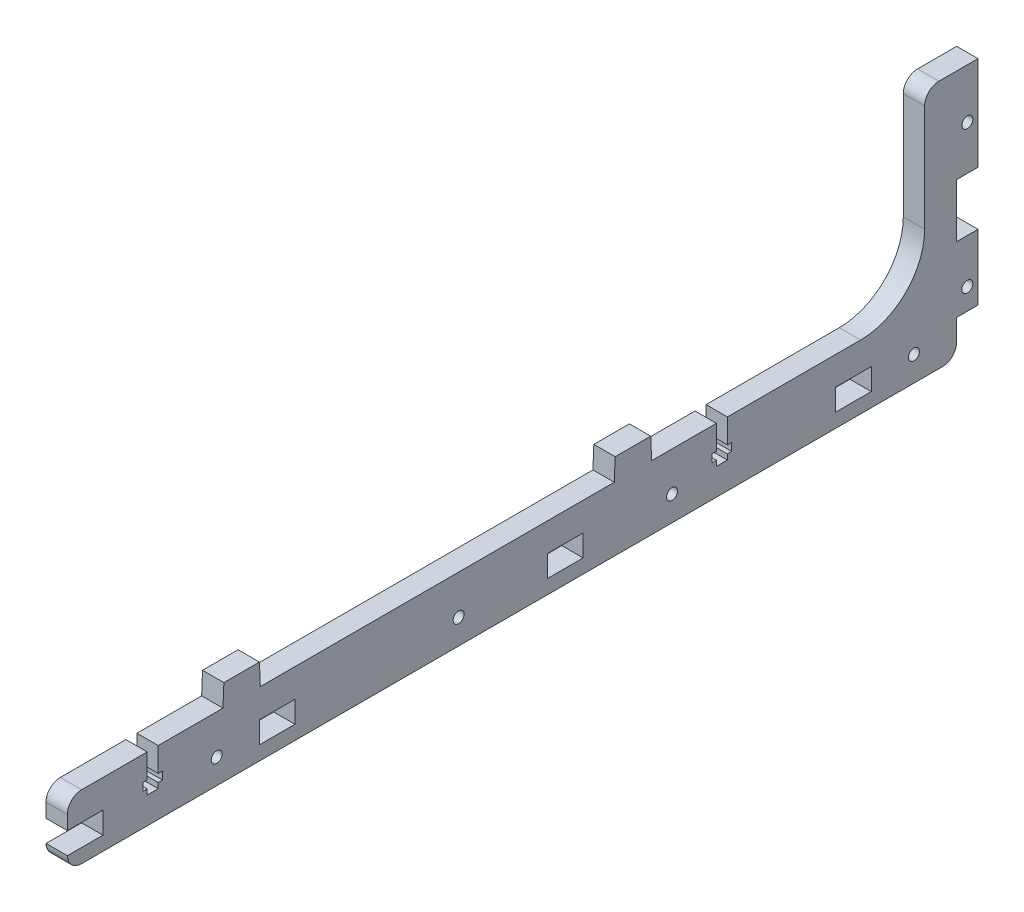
ISO-10303-21;
HEADER;
FILE_DESCRIPTION(('STEP AP214'),'2;1');
FILE_NAME('part.step','',(''),(''),'','','');
FILE_SCHEMA(('AUTOMOTIVE_DESIGN { 1 0 10303 214 1 1 1 1 }'));
ENDSEC;
DATA;
#1=APPLICATION_CONTEXT('core data for automotive mechanical design processes');
#2=APPLICATION_PROTOCOL_DEFINITION('international standard','automotive_design',2000,#1);
#3=PRODUCT_CONTEXT('',#1,'mechanical');
#4=PRODUCT('Part','Part','',(#3));
#5=PRODUCT_RELATED_PRODUCT_CATEGORY('part','',(#4));
#6=PRODUCT_DEFINITION_FORMATION('','',#4);
#7=PRODUCT_DEFINITION_CONTEXT('part definition',#1,'design');
#8=PRODUCT_DEFINITION('design','',#6,#7);
#9=PRODUCT_DEFINITION_SHAPE('','',#8);
#10=(LENGTH_UNIT() NAMED_UNIT(*) SI_UNIT(.MILLI.,.METRE.));
#11=(NAMED_UNIT(*) PLANE_ANGLE_UNIT() SI_UNIT($,.RADIAN.));
#12=(NAMED_UNIT(*) SI_UNIT($,.STERADIAN.) SOLID_ANGLE_UNIT());
#13=UNCERTAINTY_MEASURE_WITH_UNIT(LENGTH_MEASURE(1.E-05),#10,'distance_accuracy_value','');
#14=(GEOMETRIC_REPRESENTATION_CONTEXT(3) GLOBAL_UNCERTAINTY_ASSIGNED_CONTEXT((#13)) GLOBAL_UNIT_ASSIGNED_CONTEXT((#10,
#11,#12)) REPRESENTATION_CONTEXT('',''));
#15=CARTESIAN_POINT('',(0.,0.,0.));
#16=DIRECTION('',(0.,0.,1.));
#17=DIRECTION('',(1.,0.,0.));
#18=AXIS2_PLACEMENT_3D('',#15,#16,#17);
#19=CARTESIAN_POINT('',(6.,18.,91.75));
#20=DIRECTION('',(0.,-1.,0.));
#21=DIRECTION('',(0.,0.,-1.));
#22=AXIS2_PLACEMENT_3D('',#19,#20,#21);
#23=PLANE('',#22);
#24=DIRECTION('',(0.,0.,1.));
#25=VECTOR('',#24,1.);
#26=CARTESIAN_POINT('',(6.,18.,91.75));
#27=LINE('',#26,#25);
#28=CARTESIAN_POINT('',(6.,18.,73.55));
#29=VERTEX_POINT('',#28);
#30=CARTESIAN_POINT('',(6.,18.,91.75));
#31=VERTEX_POINT('',#30);
#32=EDGE_CURVE('E780',#29,#31,#27,.T.);
#33=ORIENTED_EDGE('',*,*,#32,.F.);
#34=DIRECTION('',(1.,0.,0.));
#35=VECTOR('',#34,1.);
#36=CARTESIAN_POINT('',(0.,18.,73.55));
#37=LINE('',#36,#35);
#38=CARTESIAN_POINT('',(0.,18.,73.55));
#39=VERTEX_POINT('',#38);
#40=EDGE_CURVE('E512',#39,#29,#37,.T.);
#41=ORIENTED_EDGE('',*,*,#40,.F.);
#42=DIRECTION('',(0.,0.,1.));
#43=VECTOR('',#42,1.);
#44=CARTESIAN_POINT('',(0.,18.,91.75));
#45=LINE('',#44,#43);
#46=CARTESIAN_POINT('',(0.,18.,91.75));
#47=VERTEX_POINT('',#46);
#48=EDGE_CURVE('E457',#39,#47,#45,.T.);
#49=ORIENTED_EDGE('',*,*,#48,.T.);
#50=DIRECTION('',(-1.,0.,0.));
#51=VECTOR('',#50,1.);
#52=CARTESIAN_POINT('',(6.,18.,91.75));
#53=LINE('',#52,#51);
#54=EDGE_CURVE('E912',#31,#47,#53,.T.);
#55=ORIENTED_EDGE('',*,*,#54,.F.);
#56=EDGE_LOOP('',(#33,#41,#49,#55));
#57=FACE_BOUND('',#56,.T.);
#58=ADVANCED_FACE('F32',(#57),#23,.F.);
#59=CARTESIAN_POINT('',(6.,18.,256.));
#60=DIRECTION('',(0.,-1.,0.));
#61=DIRECTION('',(0.,0.,-1.));
#62=AXIS2_PLACEMENT_3D('',#59,#60,#61);
#63=PLANE('',#62);
#64=DIRECTION('',(0.,0.,1.));
#65=VECTOR('',#64,1.);
#66=CARTESIAN_POINT('',(0.,18.,256.));
#67=LINE('',#66,#65);
#68=CARTESIAN_POINT('',(0.,18.,212.25));
#69=VERTEX_POINT('',#68);
#70=CARTESIAN_POINT('',(0.,18.,230.45));
#71=VERTEX_POINT('',#70);
#72=EDGE_CURVE('E842',#69,#71,#67,.T.);
#73=ORIENTED_EDGE('',*,*,#72,.T.);
#74=DIRECTION('',(1.,0.,0.));
#75=VECTOR('',#74,1.);
#76=CARTESIAN_POINT('',(0.,18.,230.45));
#77=LINE('',#76,#75);
#78=CARTESIAN_POINT('',(6.,18.,230.45));
#79=VERTEX_POINT('',#78);
#80=EDGE_CURVE('E597',#71,#79,#77,.T.);
#81=ORIENTED_EDGE('',*,*,#80,.T.);
#82=DIRECTION('',(0.,0.,1.));
#83=VECTOR('',#82,1.);
#84=CARTESIAN_POINT('',(6.,18.,256.));
#85=LINE('',#84,#83);
#86=CARTESIAN_POINT('',(6.,18.,212.25));
#87=VERTEX_POINT('',#86);
#88=EDGE_CURVE('E795',#87,#79,#85,.T.);
#89=ORIENTED_EDGE('',*,*,#88,.F.);
#90=DIRECTION('',(-1.,0.,0.));
#91=VECTOR('',#90,1.);
#92=CARTESIAN_POINT('',(6.,18.,212.25));
#93=LINE('',#92,#91);
#94=EDGE_CURVE('E891',#87,#69,#93,.T.);
#95=ORIENTED_EDGE('',*,*,#94,.T.);
#96=EDGE_LOOP('',(#73,#81,#89,#95));
#97=FACE_BOUND('',#96,.T.);
#98=ADVANCED_FACE('F1013',(#97),#63,.F.);
#99=CARTESIAN_POINT('',(6.,70.,0.));
#100=DIRECTION('',(0.,0.,1.));
#101=DIRECTION('',(0.,-1.,0.));
#102=AXIS2_PLACEMENT_3D('',#99,#100,#101);
#103=PLANE('',#102);
#104=DIRECTION('',(0.,1.,0.));
#105=VECTOR('',#104,1.);
#106=CARTESIAN_POINT('',(0.,70.,0.));
#107=LINE('',#106,#105);
#108=CARTESIAN_POINT('',(0.,10.,0.));
#109=VERTEX_POINT('',#108);
#110=CARTESIAN_POINT('',(0.,28.45,0.));
#111=VERTEX_POINT('',#110);
#112=EDGE_CURVE('E862',#109,#111,#107,.T.);
#113=ORIENTED_EDGE('',*,*,#112,.T.);
#114=DIRECTION('',(1.,0.,0.));
#115=VECTOR('',#114,1.);
#116=CARTESIAN_POINT('',(0.,28.45,0.));
#117=LINE('',#116,#115);
#118=CARTESIAN_POINT('',(6.,28.45,0.));
#119=VERTEX_POINT('',#118);
#120=EDGE_CURVE('E639',#111,#119,#117,.T.);
#121=ORIENTED_EDGE('',*,*,#120,.T.);
#122=DIRECTION('',(0.,1.,0.));
#123=VECTOR('',#122,1.);
#124=CARTESIAN_POINT('',(6.,70.,0.));
#125=LINE('',#124,#123);
#126=CARTESIAN_POINT('',(6.,10.,0.));
#127=VERTEX_POINT('',#126);
#128=EDGE_CURVE('E814',#127,#119,#125,.T.);
#129=ORIENTED_EDGE('',*,*,#128,.F.);
#130=DIRECTION('',(-1.,0.,0.));
#131=VECTOR('',#130,1.);
#132=CARTESIAN_POINT('',(6.,10.,0.));
#133=LINE('',#132,#131);
#134=EDGE_CURVE('E873',#127,#109,#133,.T.);
#135=ORIENTED_EDGE('',*,*,#134,.T.);
#136=EDGE_LOOP('',(#113,#121,#129,#135));
#137=FACE_BOUND('',#136,.T.);
#138=ADVANCED_FACE('F1019',(#137),#103,.F.);
#139=CARTESIAN_POINT('',(6.,0.,0.));
#140=DIRECTION('',(1.,0.,0.));
#141=DIRECTION('',(0.,0.,-1.));
#142=AXIS2_PLACEMENT_3D('',#139,#140,#141);
#143=PLANE('',#142);
#144=DIRECTION('',(0.,-1.,0.));
#145=VECTOR('',#144,1.);
#146=CARTESIAN_POINT('',(6.,18.,73.55));
#147=LINE('',#146,#145);
#148=CARTESIAN_POINT('',(6.,11.2,73.55));
#149=VERTEX_POINT('',#148);
#150=EDGE_CURVE('E438',#29,#149,#147,.T.);
#151=ORIENTED_EDGE('',*,*,#150,.F.);
#152=ORIENTED_EDGE('',*,*,#32,.T.);
#153=DIRECTION('',(0.,0.999161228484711,0.0409492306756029));
#154=VECTOR('',#153,1.);
#155=CARTESIAN_POINT('',(6.,24.1,92.));
#156=LINE('',#155,#154);
#157=CARTESIAN_POINT('',(6.,24.1,92.));
#158=VERTEX_POINT('',#157);
#159=EDGE_CURVE('E779',#31,#158,#156,.T.);
#160=ORIENTED_EDGE('',*,*,#159,.T.);
#161=DIRECTION('',(0.,0.,1.));
#162=VECTOR('',#161,1.);
#163=CARTESIAN_POINT('',(6.,24.1,102.));
#164=LINE('',#163,#162);
#165=CARTESIAN_POINT('',(6.,24.1,102.));
#166=VERTEX_POINT('',#165);
#167=EDGE_CURVE('E782',#158,#166,#164,.T.);
#168=ORIENTED_EDGE('',*,*,#167,.T.);
#169=DIRECTION('',(0.,-0.99916122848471,0.0409492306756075));
#170=VECTOR('',#169,1.);
#171=CARTESIAN_POINT('',(6.,18.,102.25));
#172=LINE('',#171,#170);
#173=CARTESIAN_POINT('',(6.,18.,102.25));
#174=VERTEX_POINT('',#173);
#175=EDGE_CURVE('E784',#166,#174,#172,.T.);
#176=ORIENTED_EDGE('',*,*,#175,.T.);
#177=DIRECTION('',(0.,0.,1.));
#178=VECTOR('',#177,1.);
#179=CARTESIAN_POINT('',(6.,18.,201.75));
#180=LINE('',#179,#178);
#181=CARTESIAN_POINT('',(6.,18.,201.75));
#182=VERTEX_POINT('',#181);
#183=EDGE_CURVE('E786',#174,#182,#180,.T.);
#184=ORIENTED_EDGE('',*,*,#183,.T.);
#185=DIRECTION('',(0.,0.99916122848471,0.0409492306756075));
#186=VECTOR('',#185,1.);
#187=CARTESIAN_POINT('',(6.,24.1,202.));
#188=LINE('',#187,#186);
#189=CARTESIAN_POINT('',(6.,24.1,202.));
#190=VERTEX_POINT('',#189);
#191=EDGE_CURVE('E788',#182,#190,#188,.T.);
#192=ORIENTED_EDGE('',*,*,#191,.T.);
#193=DIRECTION('',(0.,0.,1.));
#194=VECTOR('',#193,1.);
#195=CARTESIAN_POINT('',(6.,24.1,212.));
#196=LINE('',#195,#194);
#197=CARTESIAN_POINT('',(6.,24.1,212.));
#198=VERTEX_POINT('',#197);
#199=EDGE_CURVE('E790',#190,#198,#196,.T.);
#200=ORIENTED_EDGE('',*,*,#199,.T.);
#201=DIRECTION('',(0.,-0.999161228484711,0.0409492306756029));
#202=VECTOR('',#201,1.);
#203=CARTESIAN_POINT('',(6.,18.,212.25));
#204=LINE('',#203,#202);
#205=EDGE_CURVE('E792',#198,#87,#204,.T.);
#206=ORIENTED_EDGE('',*,*,#205,.T.);
#207=ORIENTED_EDGE('',*,*,#88,.T.);
#208=DIRECTION('',(0.,1.,0.));
#209=VECTOR('',#208,1.);
#210=CARTESIAN_POINT('',(6.,18.,230.45));
#211=LINE('',#210,#209);
#212=CARTESIAN_POINT('',(6.,11.2,230.45));
#213=VERTEX_POINT('',#212);
#214=EDGE_CURVE('E536',#213,#79,#211,.T.);
#215=ORIENTED_EDGE('',*,*,#214,.F.);
#216=DIRECTION('',(0.,0.,1.));
#217=VECTOR('',#216,1.);
#218=CARTESIAN_POINT('',(6.,11.2,230.45));
#219=LINE('',#218,#217);
#220=CARTESIAN_POINT('',(6.,11.2,229.25));
#221=VERTEX_POINT('',#220);
#222=EDGE_CURVE('E593',#221,#213,#219,.T.);
#223=ORIENTED_EDGE('',*,*,#222,.F.);
#224=DIRECTION('',(0.,1.,0.));
#225=VECTOR('',#224,1.);
#226=CARTESIAN_POINT('',(6.,11.2,229.25));
#227=LINE('',#226,#225);
#228=CARTESIAN_POINT('',(6.,9.,229.25));
#229=VERTEX_POINT('',#228);
#230=EDGE_CURVE('E590',#229,#221,#227,.T.);
#231=ORIENTED_EDGE('',*,*,#230,.F.);
#232=DIRECTION('',(0.,0.,-1.));
#233=VECTOR('',#232,1.);
#234=CARTESIAN_POINT('',(6.,9.,229.25));
#235=LINE('',#234,#233);
#236=CARTESIAN_POINT('',(6.,9.,230.45));
#237=VERTEX_POINT('',#236);
#238=EDGE_CURVE('E587',#237,#229,#235,.T.);
#239=ORIENTED_EDGE('',*,*,#238,.F.);
#240=DIRECTION('',(0.,1.,0.));
#241=VECTOR('',#240,1.);
#242=CARTESIAN_POINT('',(6.,9.,230.45));
#243=LINE('',#242,#241);
#244=CARTESIAN_POINT('',(6.,7.5,230.45));
#245=VERTEX_POINT('',#244);
#246=EDGE_CURVE('E584',#245,#237,#243,.T.);
#247=ORIENTED_EDGE('',*,*,#246,.F.);
#248=DIRECTION('',(0.,0.,-1.));
#249=VECTOR('',#248,1.);
#250=CARTESIAN_POINT('',(6.,7.5,233.55));
#251=LINE('',#250,#249);
#252=CARTESIAN_POINT('',(6.,7.5,233.55));
#253=VERTEX_POINT('',#252);
#254=EDGE_CURVE('E581',#253,#245,#251,.T.);
#255=ORIENTED_EDGE('',*,*,#254,.F.);
#256=DIRECTION('',(0.,-1.,0.));
#257=VECTOR('',#256,1.);
#258=CARTESIAN_POINT('',(6.,9.,233.55));
#259=LINE('',#258,#257);
#260=CARTESIAN_POINT('',(6.,9.,233.55));
#261=VERTEX_POINT('',#260);
#262=EDGE_CURVE('E578',#261,#253,#259,.T.);
#263=ORIENTED_EDGE('',*,*,#262,.F.);
#264=DIRECTION('',(0.,0.,-1.));
#265=VECTOR('',#264,1.);
#266=CARTESIAN_POINT('',(6.,9.,234.75));
#267=LINE('',#266,#265);
#268=CARTESIAN_POINT('',(6.,9.,234.75));
#269=VERTEX_POINT('',#268);
#270=EDGE_CURVE('E575',#269,#261,#267,.T.);
#271=ORIENTED_EDGE('',*,*,#270,.F.);
#272=DIRECTION('',(0.,-1.,0.));
#273=VECTOR('',#272,1.);
#274=CARTESIAN_POINT('',(6.,11.2,234.75));
#275=LINE('',#274,#273);
#276=CARTESIAN_POINT('',(6.,11.2,234.75));
#277=VERTEX_POINT('',#276);
#278=EDGE_CURVE('E572',#277,#269,#275,.T.);
#279=ORIENTED_EDGE('',*,*,#278,.F.);
#280=DIRECTION('',(0.,0.,1.));
#281=VECTOR('',#280,1.);
#282=CARTESIAN_POINT('',(6.,11.2,233.55));
#283=LINE('',#282,#281);
#284=CARTESIAN_POINT('',(6.,11.2,233.55));
#285=VERTEX_POINT('',#284);
#286=EDGE_CURVE('E569',#285,#277,#283,.T.);
#287=ORIENTED_EDGE('',*,*,#286,.F.);
#288=DIRECTION('',(0.,-1.,0.));
#289=VECTOR('',#288,1.);
#290=CARTESIAN_POINT('',(6.,18.,233.55));
#291=LINE('',#290,#289);
#292=CARTESIAN_POINT('',(6.,18.,233.55));
#293=VERTEX_POINT('',#292);
#294=EDGE_CURVE('E514',#293,#285,#291,.T.);
#295=ORIENTED_EDGE('',*,*,#294,.F.);
#296=CARTESIAN_POINT('',(6.,18.,252.));
#297=VERTEX_POINT('',#296);
#298=EDGE_CURVE('E794',#293,#297,#85,.T.);
#299=ORIENTED_EDGE('',*,*,#298,.T.);
#300=CARTESIAN_POINT('',(6.,14.,252.));
#301=DIRECTION('',(1.,0.,0.));
#302=DIRECTION('',(0.,0.,-1.));
#303=AXIS2_PLACEMENT_3D('',#300,#301,#302);
#304=CIRCLE('',#303,4.);
#305=CARTESIAN_POINT('',(6.,14.,256.));
#306=VERTEX_POINT('',#305);
#307=EDGE_CURVE('E934',#297,#306,#304,.T.);
#308=ORIENTED_EDGE('',*,*,#307,.T.);
#309=DIRECTION('',(0.,-1.,0.));
#310=VECTOR('',#309,1.);
#311=CARTESIAN_POINT('',(6.,10.05,256.));
#312=LINE('',#311,#310);
#313=CARTESIAN_POINT('',(6.,10.05,256.));
#314=VERTEX_POINT('',#313);
#315=EDGE_CURVE('E798',#306,#314,#312,.T.);
#316=ORIENTED_EDGE('',*,*,#315,.T.);
#317=DIRECTION('',(0.,0.,-1.));
#318=VECTOR('',#317,1.);
#319=CARTESIAN_POINT('',(6.,10.05,246.));
#320=LINE('',#319,#318);
#321=CARTESIAN_POINT('',(6.,10.05,246.));
#322=VERTEX_POINT('',#321);
#323=EDGE_CURVE('E800',#314,#322,#320,.T.);
#324=ORIENTED_EDGE('',*,*,#323,.T.);
#325=DIRECTION('',(0.,-1.,0.));
#326=VECTOR('',#325,1.);
#327=CARTESIAN_POINT('',(6.,3.95,246.));
#328=LINE('',#327,#326);
#329=CARTESIAN_POINT('',(6.,3.95,246.));
#330=VERTEX_POINT('',#329);
#331=EDGE_CURVE('E802',#322,#330,#328,.T.);
#332=ORIENTED_EDGE('',*,*,#331,.T.);
#333=DIRECTION('',(0.,0.,1.));
#334=VECTOR('',#333,1.);
#335=CARTESIAN_POINT('',(6.,3.94999999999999,256.));
#336=LINE('',#335,#334);
#337=CARTESIAN_POINT('',(6.,3.94999999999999,256.));
#338=VERTEX_POINT('',#337);
#339=EDGE_CURVE('E804',#330,#338,#336,.T.);
#340=ORIENTED_EDGE('',*,*,#339,.T.);
#341=CARTESIAN_POINT('',(6.,3.99999999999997,252.000312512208));
#342=DIRECTION('',(1.,0.,0.));
#343=DIRECTION('',(0.,0.,-1.));
#344=AXIS2_PLACEMENT_3D('',#341,#342,#343);
#345=CIRCLE('',#344,4.);
#346=CARTESIAN_POINT('',(6.,0.,252.000312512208));
#347=VERTEX_POINT('',#346);
#348=EDGE_CURVE('E932',#338,#347,#345,.T.);
#349=ORIENTED_EDGE('',*,*,#348,.T.);
#350=DIRECTION('',(0.,0.,-1.));
#351=VECTOR('',#350,1.);
#352=CARTESIAN_POINT('',(6.,0.,5.99999999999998));
#353=LINE('',#352,#351);
#354=CARTESIAN_POINT('',(6.,0.,9.99999999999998));
#355=VERTEX_POINT('',#354);
#356=EDGE_CURVE('E806',#347,#355,#353,.T.);
#357=ORIENTED_EDGE('',*,*,#356,.T.);
#358=CARTESIAN_POINT('',(6.,4.,9.99999999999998));
#359=DIRECTION('',(1.,0.,0.));
#360=DIRECTION('',(0.,0.,-1.));
#361=AXIS2_PLACEMENT_3D('',#358,#359,#360);
#362=CIRCLE('',#361,4.);
#363=CARTESIAN_POINT('',(6.,4.,5.99999999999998));
#364=VERTEX_POINT('',#363);
#365=EDGE_CURVE('E938',#355,#364,#362,.T.);
#366=ORIENTED_EDGE('',*,*,#365,.T.);
#367=DIRECTION('',(0.,1.,0.));
#368=VECTOR('',#367,1.);
#369=CARTESIAN_POINT('',(6.,10.,5.99999999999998));
#370=LINE('',#369,#368);
#371=CARTESIAN_POINT('',(6.,10.,5.99999999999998));
#372=VERTEX_POINT('',#371);
#373=EDGE_CURVE('E809',#364,#372,#370,.T.);
#374=ORIENTED_EDGE('',*,*,#373,.T.);
#375=DIRECTION('',(0.,0.,-1.));
#376=VECTOR('',#375,1.);
#377=CARTESIAN_POINT('',(6.,10.,0.));
#378=LINE('',#377,#376);
#379=EDGE_CURVE('E811',#372,#127,#378,.T.);
#380=ORIENTED_EDGE('',*,*,#379,.T.);
#381=ORIENTED_EDGE('',*,*,#128,.T.);
#382=DIRECTION('',(0.,0.,-1.));
#383=VECTOR('',#382,1.);
#384=CARTESIAN_POINT('',(6.,28.45,0.));
#385=LINE('',#384,#383);
#386=CARTESIAN_POINT('',(6.,28.45,6.1));
#387=VERTEX_POINT('',#386);
#388=EDGE_CURVE('E626',#387,#119,#385,.T.);
#389=ORIENTED_EDGE('',*,*,#388,.F.);
#390=DIRECTION('',(0.,-1.,0.));
#391=VECTOR('',#390,1.);
#392=CARTESIAN_POINT('',(6.,43.55,6.09999999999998));
#393=LINE('',#392,#391);
#394=CARTESIAN_POINT('',(6.,43.55,6.09999999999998));
#395=VERTEX_POINT('',#394);
#396=EDGE_CURVE('E635',#395,#387,#393,.T.);
#397=ORIENTED_EDGE('',*,*,#396,.F.);
#398=DIRECTION('',(0.,0.,1.));
#399=VECTOR('',#398,1.);
#400=CARTESIAN_POINT('',(6.,43.55,0.));
#401=LINE('',#400,#399);
#402=CARTESIAN_POINT('',(6.,43.55,0.));
#403=VERTEX_POINT('',#402);
#404=EDGE_CURVE('E600',#403,#395,#401,.T.);
#405=ORIENTED_EDGE('',*,*,#404,.F.);
#406=CARTESIAN_POINT('',(6.,70.,0.));
#407=VERTEX_POINT('',#406);
#408=EDGE_CURVE('E813',#403,#407,#125,.T.);
#409=ORIENTED_EDGE('',*,*,#408,.T.);
#410=DIRECTION('',(0.,0.,1.));
#411=VECTOR('',#410,1.);
#412=CARTESIAN_POINT('',(6.,70.,15.));
#413=LINE('',#412,#411);
#414=CARTESIAN_POINT('',(6.,70.,11.));
#415=VERTEX_POINT('',#414);
#416=EDGE_CURVE('E817',#407,#415,#413,.T.);
#417=ORIENTED_EDGE('',*,*,#416,.T.);
#418=CARTESIAN_POINT('',(6.,66.,11.));
#419=DIRECTION('',(1.,0.,0.));
#420=DIRECTION('',(0.,0.,-1.));
#421=AXIS2_PLACEMENT_3D('',#418,#419,#420);
#422=CIRCLE('',#421,4.);
#423=CARTESIAN_POINT('',(6.,66.,15.));
#424=VERTEX_POINT('',#423);
#425=EDGE_CURVE('E936',#415,#424,#422,.T.);
#426=ORIENTED_EDGE('',*,*,#425,.T.);
#427=DIRECTION('',(0.,-1.,0.));
#428=VECTOR('',#427,1.);
#429=CARTESIAN_POINT('',(6.,18.,15.));
#430=LINE('',#429,#428);
#431=CARTESIAN_POINT('',(6.,36.,15.));
#432=VERTEX_POINT('',#431);
#433=EDGE_CURVE('E820',#424,#432,#430,.T.);
#434=ORIENTED_EDGE('',*,*,#433,.T.);
#435=CARTESIAN_POINT('',(6.,36.,33.));
#436=DIRECTION('',(1.,0.,0.));
#437=DIRECTION('',(0.,0.,-1.));
#438=AXIS2_PLACEMENT_3D('',#435,#436,#437);
#439=CIRCLE('',#438,18.);
#440=CARTESIAN_POINT('',(6.,18.,33.));
#441=VERTEX_POINT('',#440);
#442=EDGE_CURVE('E11',#432,#441,#439,.F.);
#443=ORIENTED_EDGE('',*,*,#442,.T.);
#444=CARTESIAN_POINT('',(6.,18.,70.45));
#445=VERTEX_POINT('',#444);
#446=EDGE_CURVE('E776',#441,#445,#27,.T.);
#447=ORIENTED_EDGE('',*,*,#446,.T.);
#448=DIRECTION('',(0.,1.,0.));
#449=VECTOR('',#448,1.);
#450=CARTESIAN_POINT('',(6.,18.,70.45));
#451=LINE('',#450,#449);
#452=CARTESIAN_POINT('',(6.,11.2,70.45));
#453=VERTEX_POINT('',#452);
#454=EDGE_CURVE('E47',#453,#445,#451,.T.);
#455=ORIENTED_EDGE('',*,*,#454,.F.);
#456=DIRECTION('',(0.,0.,1.));
#457=VECTOR('',#456,1.);
#458=CARTESIAN_POINT('',(6.,11.2,70.45));
#459=LINE('',#458,#457);
#460=CARTESIAN_POINT('',(6.,11.2,69.25));
#461=VERTEX_POINT('',#460);
#462=EDGE_CURVE('E459',#461,#453,#459,.T.);
#463=ORIENTED_EDGE('',*,*,#462,.F.);
#464=DIRECTION('',(0.,1.,0.));
#465=VECTOR('',#464,1.);
#466=CARTESIAN_POINT('',(6.,11.2,69.25));
#467=LINE('',#466,#465);
#468=CARTESIAN_POINT('',(6.,9.00000000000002,69.25));
#469=VERTEX_POINT('',#468);
#470=EDGE_CURVE('E507',#469,#461,#467,.T.);
#471=ORIENTED_EDGE('',*,*,#470,.F.);
#472=DIRECTION('',(0.,0.,-1.));
#473=VECTOR('',#472,1.);
#474=CARTESIAN_POINT('',(6.,9.00000000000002,69.25));
#475=LINE('',#474,#473);
#476=CARTESIAN_POINT('',(6.,9.00000000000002,70.45));
#477=VERTEX_POINT('',#476);
#478=EDGE_CURVE('E504',#477,#469,#475,.T.);
#479=ORIENTED_EDGE('',*,*,#478,.F.);
#480=DIRECTION('',(0.,1.,0.));
#481=VECTOR('',#480,1.);
#482=CARTESIAN_POINT('',(6.,9.00000000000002,70.45));
#483=LINE('',#482,#481);
#484=CARTESIAN_POINT('',(6.,7.50000000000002,70.45));
#485=VERTEX_POINT('',#484);
#486=EDGE_CURVE('E501',#485,#477,#483,.T.);
#487=ORIENTED_EDGE('',*,*,#486,.F.);
#488=DIRECTION('',(0.,0.,-1.));
#489=VECTOR('',#488,1.);
#490=CARTESIAN_POINT('',(6.,7.50000000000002,73.55));
#491=LINE('',#490,#489);
#492=CARTESIAN_POINT('',(6.,7.50000000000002,73.55));
#493=VERTEX_POINT('',#492);
#494=EDGE_CURVE('E498',#493,#485,#491,.T.);
#495=ORIENTED_EDGE('',*,*,#494,.F.);
#496=DIRECTION('',(0.,-1.,0.));
#497=VECTOR('',#496,1.);
#498=CARTESIAN_POINT('',(6.,9.00000000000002,73.55));
#499=LINE('',#498,#497);
#500=CARTESIAN_POINT('',(6.,9.00000000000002,73.55));
#501=VERTEX_POINT('',#500);
#502=EDGE_CURVE('E495',#501,#493,#499,.T.);
#503=ORIENTED_EDGE('',*,*,#502,.F.);
#504=DIRECTION('',(0.,0.,-1.));
#505=VECTOR('',#504,1.);
#506=CARTESIAN_POINT('',(6.,9.00000000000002,74.75));
#507=LINE('',#506,#505);
#508=CARTESIAN_POINT('',(6.,9.00000000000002,74.75));
#509=VERTEX_POINT('',#508);
#510=EDGE_CURVE('E492',#509,#501,#507,.T.);
#511=ORIENTED_EDGE('',*,*,#510,.F.);
#512=DIRECTION('',(0.,-1.,0.));
#513=VECTOR('',#512,1.);
#514=CARTESIAN_POINT('',(6.,11.2,74.75));
#515=LINE('',#514,#513);
#516=CARTESIAN_POINT('',(6.,11.2,74.75));
#517=VERTEX_POINT('',#516);
#518=EDGE_CURVE('E489',#517,#509,#515,.T.);
#519=ORIENTED_EDGE('',*,*,#518,.F.);
#520=DIRECTION('',(0.,0.,1.));
#521=VECTOR('',#520,1.);
#522=CARTESIAN_POINT('',(6.,11.2,73.55));
#523=LINE('',#522,#521);
#524=EDGE_CURVE('E487',#149,#517,#523,.T.);
#525=ORIENTED_EDGE('',*,*,#524,.F.);
#526=EDGE_LOOP('',(#151,#152,#160,#168,#176,#184,#192,#200,#206,#207,#215,#223,#231,#239,#247,
#255,#263,#271,#279,#287,#295,#299,#308,#316,#324,#332,#340,#349,#357,#366,#374,#380,#381,#389,
#397,#405,#409,#417,#426,#434,#443,#447,#455,#463,#471,#479,#487,#495,#503,#511,#519,#525));
#527=FACE_BOUND('',#526,.T.);
#528=CARTESIAN_POINT('',(6.,7.,18.));
#529=DIRECTION('',(1.,0.,0.));
#530=DIRECTION('',(0.,0.,-1.));
#531=AXIS2_PLACEMENT_3D('',#528,#529,#530);
#532=CIRCLE('',#531,1.55);
#533=CARTESIAN_POINT('',(6.,7.,16.45));
#534=VERTEX_POINT('',#533);
#535=EDGE_CURVE('E642',#534,#534,#532,.T.);
#536=ORIENTED_EDGE('',*,*,#535,.F.);
#537=EDGE_LOOP('',(#536));
#538=FACE_BOUND('',#537,.T.);
#539=CARTESIAN_POINT('',(6.,7.,86.));
#540=DIRECTION('',(1.,0.,0.));
#541=DIRECTION('',(0.,0.,-1.));
#542=AXIS2_PLACEMENT_3D('',#539,#540,#541);
#543=CIRCLE('',#542,1.54999999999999);
#544=CARTESIAN_POINT('',(6.,7.,84.45));
#545=VERTEX_POINT('',#544);
#546=EDGE_CURVE('E651',#545,#545,#543,.T.);
#547=ORIENTED_EDGE('',*,*,#546,.F.);
#548=EDGE_LOOP('',(#547));
#549=FACE_BOUND('',#548,.T.);
#550=CARTESIAN_POINT('',(6.,7.,146.));
#551=DIRECTION('',(1.,0.,0.));
#552=DIRECTION('',(0.,0.,-1.));
#553=AXIS2_PLACEMENT_3D('',#550,#551,#552);
#554=CIRCLE('',#553,1.54999999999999);
#555=CARTESIAN_POINT('',(6.,7.,144.45));
#556=VERTEX_POINT('',#555);
#557=EDGE_CURVE('E657',#556,#556,#554,.T.);
#558=ORIENTED_EDGE('',*,*,#557,.F.);
#559=EDGE_LOOP('',(#558));
#560=FACE_BOUND('',#559,.T.);
#561=CARTESIAN_POINT('',(6.,7.,214.));
#562=DIRECTION('',(1.,0.,0.));
#563=DIRECTION('',(0.,0.,1.));
#564=AXIS2_PLACEMENT_3D('',#561,#562,#563);
#565=CIRCLE('',#564,1.55000000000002);
#566=CARTESIAN_POINT('',(6.,7.,215.55));
#567=VERTEX_POINT('',#566);
#568=EDGE_CURVE('E663',#567,#567,#565,.T.);
#569=ORIENTED_EDGE('',*,*,#568,.F.);
#570=EDGE_LOOP('',(#569));
#571=FACE_BOUND('',#570,.T.);
#572=CARTESIAN_POINT('',(6.,16.,2.99999999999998));
#573=DIRECTION('',(1.,0.,0.));
#574=DIRECTION('',(0.,0.,1.));
#575=AXIS2_PLACEMENT_3D('',#572,#573,#574);
#576=CIRCLE('',#575,1.54999999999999);
#577=CARTESIAN_POINT('',(6.,16.,4.54999999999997));
#578=VERTEX_POINT('',#577);
#579=EDGE_CURVE('E669',#578,#578,#576,.T.);
#580=ORIENTED_EDGE('',*,*,#579,.F.);
#581=EDGE_LOOP('',(#580));
#582=FACE_BOUND('',#581,.T.);
#583=CARTESIAN_POINT('',(6.,56.,2.99999999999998));
#584=DIRECTION('',(1.,0.,0.));
#585=DIRECTION('',(0.,0.,-1.));
#586=AXIS2_PLACEMENT_3D('',#583,#584,#585);
#587=CIRCLE('',#586,1.54999999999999);
#588=CARTESIAN_POINT('',(6.,56.,1.45));
#589=VERTEX_POINT('',#588);
#590=EDGE_CURVE('E675',#589,#589,#587,.T.);
#591=ORIENTED_EDGE('',*,*,#590,.F.);
#592=EDGE_LOOP('',(#591));
#593=FACE_BOUND('',#592,.T.);
#594=DIRECTION('',(0.,0.,-1.));
#595=VECTOR('',#594,1.);
#596=CARTESIAN_POINT('',(6.,3.95,121.));
#597=LINE('',#596,#595);
#598=CARTESIAN_POINT('',(6.,3.95,121.));
#599=VERTEX_POINT('',#598);
#600=CARTESIAN_POINT('',(6.,3.95,111.));
#601=VERTEX_POINT('',#600);
#602=EDGE_CURVE('E748',#599,#601,#597,.T.);
#603=ORIENTED_EDGE('',*,*,#602,.F.);
#604=DIRECTION('',(0.,-1.,0.));
#605=VECTOR('',#604,1.);
#606=CARTESIAN_POINT('',(6.,10.05,121.));
#607=LINE('',#606,#605);
#608=CARTESIAN_POINT('',(6.,10.05,121.));
#609=VERTEX_POINT('',#608);
#610=EDGE_CURVE('E746',#609,#599,#607,.T.);
#611=ORIENTED_EDGE('',*,*,#610,.F.);
#612=DIRECTION('',(0.,0.,1.));
#613=VECTOR('',#612,1.);
#614=CARTESIAN_POINT('',(6.,10.05,121.));
#615=LINE('',#614,#613);
#616=CARTESIAN_POINT('',(6.,10.05,111.));
#617=VERTEX_POINT('',#616);
#618=EDGE_CURVE('E754',#617,#609,#615,.T.);
#619=ORIENTED_EDGE('',*,*,#618,.F.);
#620=DIRECTION('',(0.,1.,0.));
#621=VECTOR('',#620,1.);
#622=CARTESIAN_POINT('',(6.,10.05,111.));
#623=LINE('',#622,#621);
#624=EDGE_CURVE('E751',#601,#617,#623,.T.);
#625=ORIENTED_EDGE('',*,*,#624,.F.);
#626=EDGE_LOOP('',(#603,#611,#619,#625));
#627=FACE_BOUND('',#626,.T.);
#628=DIRECTION('',(0.,0.,-1.));
#629=VECTOR('',#628,1.);
#630=CARTESIAN_POINT('',(6.,3.94999999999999,40.));
#631=LINE('',#630,#629);
#632=CARTESIAN_POINT('',(6.,3.94999999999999,40.));
#633=VERTEX_POINT('',#632);
#634=CARTESIAN_POINT('',(6.,3.94999999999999,30.));
#635=VERTEX_POINT('',#634);
#636=EDGE_CURVE('E717',#633,#635,#631,.T.);
#637=ORIENTED_EDGE('',*,*,#636,.F.);
#638=DIRECTION('',(0.,-1.,0.));
#639=VECTOR('',#638,1.);
#640=CARTESIAN_POINT('',(6.,10.05,40.));
#641=LINE('',#640,#639);
#642=CARTESIAN_POINT('',(6.,10.05,40.));
#643=VERTEX_POINT('',#642);
#644=EDGE_CURVE('E715',#643,#633,#641,.T.);
#645=ORIENTED_EDGE('',*,*,#644,.F.);
#646=DIRECTION('',(0.,0.,1.));
#647=VECTOR('',#646,1.);
#648=CARTESIAN_POINT('',(6.,10.05,40.));
#649=LINE('',#648,#647);
#650=CARTESIAN_POINT('',(6.,10.05,30.));
#651=VERTEX_POINT('',#650);
#652=EDGE_CURVE('E723',#651,#643,#649,.T.);
#653=ORIENTED_EDGE('',*,*,#652,.F.);
#654=DIRECTION('',(0.,1.,0.));
#655=VECTOR('',#654,1.);
#656=CARTESIAN_POINT('',(6.,10.05,30.));
#657=LINE('',#656,#655);
#658=EDGE_CURVE('E720',#635,#651,#657,.T.);
#659=ORIENTED_EDGE('',*,*,#658,.F.);
#660=EDGE_LOOP('',(#637,#645,#653,#659));
#661=FACE_BOUND('',#660,.T.);
#662=DIRECTION('',(0.,-1.,0.));
#663=VECTOR('',#662,1.);
#664=CARTESIAN_POINT('',(6.,10.05,202.));
#665=LINE('',#664,#663);
#666=CARTESIAN_POINT('',(6.,10.05,202.));
#667=VERTEX_POINT('',#666);
#668=CARTESIAN_POINT('',(6.,3.94999999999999,202.));
#669=VERTEX_POINT('',#668);
#670=EDGE_CURVE('E686',#667,#669,#665,.T.);
#671=ORIENTED_EDGE('',*,*,#670,.F.);
#672=DIRECTION('',(0.,0.,1.));
#673=VECTOR('',#672,1.);
#674=CARTESIAN_POINT('',(6.,10.05,192.));
#675=LINE('',#674,#673);
#676=CARTESIAN_POINT('',(6.,10.05,192.));
#677=VERTEX_POINT('',#676);
#678=EDGE_CURVE('E684',#677,#667,#675,.T.);
#679=ORIENTED_EDGE('',*,*,#678,.F.);
#680=DIRECTION('',(0.,1.,0.));
#681=VECTOR('',#680,1.);
#682=CARTESIAN_POINT('',(6.,10.05,192.));
#683=LINE('',#682,#681);
#684=CARTESIAN_POINT('',(6.,3.94999999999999,192.));
#685=VERTEX_POINT('',#684);
#686=EDGE_CURVE('E692',#685,#677,#683,.T.);
#687=ORIENTED_EDGE('',*,*,#686,.F.);
#688=DIRECTION('',(0.,0.,-1.));
#689=VECTOR('',#688,1.);
#690=CARTESIAN_POINT('',(6.,3.94999999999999,192.));
#691=LINE('',#690,#689);
#692=EDGE_CURVE('E689',#669,#685,#691,.T.);
#693=ORIENTED_EDGE('',*,*,#692,.F.);
#694=EDGE_LOOP('',(#671,#679,#687,#693));
#695=FACE_BOUND('',#694,.T.);
#696=ADVANCED_FACE('F967',(#527,#538,#549,#560,#571,#582,#593,#627,#661,#695),#143,.T.);
#697=CARTESIAN_POINT('',(0.,0.,0.));
#698=DIRECTION('',(1.,0.,0.));
#699=DIRECTION('',(0.,0.,-1.));
#700=AXIS2_PLACEMENT_3D('',#697,#698,#699);
#701=PLANE('',#700);
#702=ORIENTED_EDGE('',*,*,#48,.F.);
#703=DIRECTION('',(0.,-1.,0.));
#704=VECTOR('',#703,1.);
#705=CARTESIAN_POINT('',(0.,18.,73.55));
#706=LINE('',#705,#704);
#707=CARTESIAN_POINT('',(0.,11.2,73.55));
#708=VERTEX_POINT('',#707);
#709=EDGE_CURVE('E435',#39,#708,#706,.T.);
#710=ORIENTED_EDGE('',*,*,#709,.T.);
#711=DIRECTION('',(0.,0.,1.));
#712=VECTOR('',#711,1.);
#713=CARTESIAN_POINT('',(0.,11.2,73.55));
#714=LINE('',#713,#712);
#715=CARTESIAN_POINT('',(0.,11.2,74.75));
#716=VERTEX_POINT('',#715);
#717=EDGE_CURVE('E446',#708,#716,#714,.T.);
#718=ORIENTED_EDGE('',*,*,#717,.T.);
#719=DIRECTION('',(0.,-1.,0.));
#720=VECTOR('',#719,1.);
#721=CARTESIAN_POINT('',(0.,11.2,74.75));
#722=LINE('',#721,#720);
#723=CARTESIAN_POINT('',(0.,9.00000000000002,74.75));
#724=VERTEX_POINT('',#723);
#725=EDGE_CURVE('E451',#716,#724,#722,.T.);
#726=ORIENTED_EDGE('',*,*,#725,.T.);
#727=DIRECTION('',(0.,0.,-1.));
#728=VECTOR('',#727,1.);
#729=CARTESIAN_POINT('',(0.,9.00000000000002,74.75));
#730=LINE('',#729,#728);
#731=CARTESIAN_POINT('',(0.,9.00000000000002,73.55));
#732=VERTEX_POINT('',#731);
#733=EDGE_CURVE('E463',#724,#732,#730,.T.);
#734=ORIENTED_EDGE('',*,*,#733,.T.);
#735=DIRECTION('',(0.,-1.,0.));
#736=VECTOR('',#735,1.);
#737=CARTESIAN_POINT('',(0.,9.00000000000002,73.55));
#738=LINE('',#737,#736);
#739=CARTESIAN_POINT('',(0.,7.50000000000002,73.55));
#740=VERTEX_POINT('',#739);
#741=EDGE_CURVE('E466',#732,#740,#738,.T.);
#742=ORIENTED_EDGE('',*,*,#741,.T.);
#743=DIRECTION('',(0.,0.,-1.));
#744=VECTOR('',#743,1.);
#745=CARTESIAN_POINT('',(0.,7.50000000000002,73.55));
#746=LINE('',#745,#744);
#747=CARTESIAN_POINT('',(0.,7.50000000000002,70.45));
#748=VERTEX_POINT('',#747);
#749=EDGE_CURVE('E469',#740,#748,#746,.T.);
#750=ORIENTED_EDGE('',*,*,#749,.T.);
#751=DIRECTION('',(0.,1.,0.));
#752=VECTOR('',#751,1.);
#753=CARTESIAN_POINT('',(0.,9.00000000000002,70.45));
#754=LINE('',#753,#752);
#755=CARTESIAN_POINT('',(0.,9.00000000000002,70.45));
#756=VERTEX_POINT('',#755);
#757=EDGE_CURVE('E472',#748,#756,#754,.T.);
#758=ORIENTED_EDGE('',*,*,#757,.T.);
#759=DIRECTION('',(0.,0.,-1.));
#760=VECTOR('',#759,1.);
#761=CARTESIAN_POINT('',(0.,9.00000000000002,69.25));
#762=LINE('',#761,#760);
#763=CARTESIAN_POINT('',(0.,9.00000000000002,69.25));
#764=VERTEX_POINT('',#763);
#765=EDGE_CURVE('E475',#756,#764,#762,.T.);
#766=ORIENTED_EDGE('',*,*,#765,.T.);
#767=DIRECTION('',(0.,1.,0.));
#768=VECTOR('',#767,1.);
#769=CARTESIAN_POINT('',(0.,11.2,69.25));
#770=LINE('',#769,#768);
#771=CARTESIAN_POINT('',(0.,11.2,69.25));
#772=VERTEX_POINT('',#771);
#773=EDGE_CURVE('E478',#764,#772,#770,.T.);
#774=ORIENTED_EDGE('',*,*,#773,.T.);
#775=DIRECTION('',(0.,0.,1.));
#776=VECTOR('',#775,1.);
#777=CARTESIAN_POINT('',(0.,11.2,70.45));
#778=LINE('',#777,#776);
#779=CARTESIAN_POINT('',(0.,11.2,70.45));
#780=VERTEX_POINT('',#779);
#781=EDGE_CURVE('E481',#772,#780,#778,.T.);
#782=ORIENTED_EDGE('',*,*,#781,.T.);
#783=DIRECTION('',(0.,1.,0.));
#784=VECTOR('',#783,1.);
#785=CARTESIAN_POINT('',(0.,18.,70.45));
#786=LINE('',#785,#784);
#787=CARTESIAN_POINT('',(0.,18.,70.45));
#788=VERTEX_POINT('',#787);
#789=EDGE_CURVE('E443',#780,#788,#786,.T.);
#790=ORIENTED_EDGE('',*,*,#789,.T.);
#791=CARTESIAN_POINT('',(0.,18.,33.));
#792=VERTEX_POINT('',#791);
#793=EDGE_CURVE('E824',#792,#788,#45,.T.);
#794=ORIENTED_EDGE('',*,*,#793,.F.);
#795=CARTESIAN_POINT('',(0.,36.,33.));
#796=DIRECTION('',(1.,0.,0.));
#797=DIRECTION('',(0.,0.,-1.));
#798=AXIS2_PLACEMENT_3D('',#795,#796,#797);
#799=CIRCLE('',#798,18.);
#800=CARTESIAN_POINT('',(0.,36.,15.));
#801=VERTEX_POINT('',#800);
#802=EDGE_CURVE('E40',#792,#801,#799,.T.);
#803=ORIENTED_EDGE('',*,*,#802,.T.);
#804=DIRECTION('',(0.,-1.,0.));
#805=VECTOR('',#804,1.);
#806=CARTESIAN_POINT('',(0.,18.,15.));
#807=LINE('',#806,#805);
#808=CARTESIAN_POINT('',(0.,66.,15.));
#809=VERTEX_POINT('',#808);
#810=EDGE_CURVE('E868',#809,#801,#807,.T.);
#811=ORIENTED_EDGE('',*,*,#810,.F.);
#812=CARTESIAN_POINT('',(0.,66.,11.));
#813=DIRECTION('',(1.,0.,0.));
#814=DIRECTION('',(0.,0.,-1.));
#815=AXIS2_PLACEMENT_3D('',#812,#813,#814);
#816=CIRCLE('',#815,4.);
#817=CARTESIAN_POINT('',(0.,70.,11.));
#818=VERTEX_POINT('',#817);
#819=EDGE_CURVE('E923',#809,#818,#816,.F.);
#820=ORIENTED_EDGE('',*,*,#819,.T.);
#821=DIRECTION('',(0.,0.,1.));
#822=VECTOR('',#821,1.);
#823=CARTESIAN_POINT('',(0.,70.,15.));
#824=LINE('',#823,#822);
#825=CARTESIAN_POINT('',(0.,70.,0.));
#826=VERTEX_POINT('',#825);
#827=EDGE_CURVE('E865',#826,#818,#824,.T.);
#828=ORIENTED_EDGE('',*,*,#827,.F.);
#829=CARTESIAN_POINT('',(0.,43.55,0.));
#830=VERTEX_POINT('',#829);
#831=EDGE_CURVE('E861',#830,#826,#107,.T.);
#832=ORIENTED_EDGE('',*,*,#831,.F.);
#833=DIRECTION('',(0.,0.,1.));
#834=VECTOR('',#833,1.);
#835=CARTESIAN_POINT('',(0.,43.55,0.));
#836=LINE('',#835,#834);
#837=CARTESIAN_POINT('',(0.,43.55,6.09999999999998));
#838=VERTEX_POINT('',#837);
#839=EDGE_CURVE('E622',#830,#838,#836,.T.);
#840=ORIENTED_EDGE('',*,*,#839,.T.);
#841=DIRECTION('',(0.,-1.,0.));
#842=VECTOR('',#841,1.);
#843=CARTESIAN_POINT('',(0.,43.55,6.09999999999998));
#844=LINE('',#843,#842);
#845=CARTESIAN_POINT('',(0.,28.45,6.1));
#846=VERTEX_POINT('',#845);
#847=EDGE_CURVE('E625',#838,#846,#844,.T.);
#848=ORIENTED_EDGE('',*,*,#847,.T.);
#849=DIRECTION('',(0.,0.,-1.));
#850=VECTOR('',#849,1.);
#851=CARTESIAN_POINT('',(0.,28.45,0.));
#852=LINE('',#851,#850);
#853=EDGE_CURVE('E629',#846,#111,#852,.T.);
#854=ORIENTED_EDGE('',*,*,#853,.T.);
#855=ORIENTED_EDGE('',*,*,#112,.F.);
#856=DIRECTION('',(0.,0.,-1.));
#857=VECTOR('',#856,1.);
#858=CARTESIAN_POINT('',(0.,10.,0.));
#859=LINE('',#858,#857);
#860=CARTESIAN_POINT('',(0.,10.,5.99999999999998));
#861=VERTEX_POINT('',#860);
#862=EDGE_CURVE('E859',#861,#109,#859,.T.);
#863=ORIENTED_EDGE('',*,*,#862,.F.);
#864=DIRECTION('',(0.,1.,0.));
#865=VECTOR('',#864,1.);
#866=CARTESIAN_POINT('',(0.,10.,5.99999999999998));
#867=LINE('',#866,#865);
#868=CARTESIAN_POINT('',(0.,4.,5.99999999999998));
#869=VERTEX_POINT('',#868);
#870=EDGE_CURVE('E857',#869,#861,#867,.T.);
#871=ORIENTED_EDGE('',*,*,#870,.F.);
#872=CARTESIAN_POINT('',(0.,4.,9.99999999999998));
#873=DIRECTION('',(1.,0.,0.));
#874=DIRECTION('',(0.,0.,-1.));
#875=AXIS2_PLACEMENT_3D('',#872,#873,#874);
#876=CIRCLE('',#875,4.);
#877=CARTESIAN_POINT('',(0.,0.,9.99999999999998));
#878=VERTEX_POINT('',#877);
#879=EDGE_CURVE('E925',#869,#878,#876,.F.);
#880=ORIENTED_EDGE('',*,*,#879,.T.);
#881=DIRECTION('',(0.,0.,-1.));
#882=VECTOR('',#881,1.);
#883=CARTESIAN_POINT('',(0.,0.,5.99999999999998));
#884=LINE('',#883,#882);
#885=CARTESIAN_POINT('',(0.,0.,252.000312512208));
#886=VERTEX_POINT('',#885);
#887=EDGE_CURVE('E854',#886,#878,#884,.T.);
#888=ORIENTED_EDGE('',*,*,#887,.F.);
#889=CARTESIAN_POINT('',(0.,3.99999999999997,252.000312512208));
#890=DIRECTION('',(1.,0.,0.));
#891=DIRECTION('',(0.,0.,-1.));
#892=AXIS2_PLACEMENT_3D('',#889,#890,#891);
#893=CIRCLE('',#892,4.);
#894=CARTESIAN_POINT('',(0.,3.94999999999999,256.));
#895=VERTEX_POINT('',#894);
#896=EDGE_CURVE('E918',#886,#895,#893,.F.);
#897=ORIENTED_EDGE('',*,*,#896,.T.);
#898=DIRECTION('',(0.,0.,1.));
#899=VECTOR('',#898,1.);
#900=CARTESIAN_POINT('',(0.,3.94999999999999,256.));
#901=LINE('',#900,#899);
#902=CARTESIAN_POINT('',(0.,3.95,246.));
#903=VERTEX_POINT('',#902);
#904=EDGE_CURVE('E851',#903,#895,#901,.T.);
#905=ORIENTED_EDGE('',*,*,#904,.F.);
#906=DIRECTION('',(0.,-1.,0.));
#907=VECTOR('',#906,1.);
#908=CARTESIAN_POINT('',(0.,3.95,246.));
#909=LINE('',#908,#907);
#910=CARTESIAN_POINT('',(0.,10.05,246.));
#911=VERTEX_POINT('',#910);
#912=EDGE_CURVE('E849',#911,#903,#909,.T.);
#913=ORIENTED_EDGE('',*,*,#912,.F.);
#914=DIRECTION('',(0.,0.,-1.));
#915=VECTOR('',#914,1.);
#916=CARTESIAN_POINT('',(0.,10.05,246.));
#917=LINE('',#916,#915);
#918=CARTESIAN_POINT('',(0.,10.05,256.));
#919=VERTEX_POINT('',#918);
#920=EDGE_CURVE('E847',#919,#911,#917,.T.);
#921=ORIENTED_EDGE('',*,*,#920,.F.);
#922=DIRECTION('',(0.,-1.,0.));
#923=VECTOR('',#922,1.);
#924=CARTESIAN_POINT('',(0.,10.05,256.));
#925=LINE('',#924,#923);
#926=CARTESIAN_POINT('',(0.,14.,256.));
#927=VERTEX_POINT('',#926);
#928=EDGE_CURVE('E845',#927,#919,#925,.T.);
#929=ORIENTED_EDGE('',*,*,#928,.F.);
#930=CARTESIAN_POINT('',(0.,14.,252.));
#931=DIRECTION('',(1.,0.,0.));
#932=DIRECTION('',(0.,0.,-1.));
#933=AXIS2_PLACEMENT_3D('',#930,#931,#932);
#934=CIRCLE('',#933,4.);
#935=CARTESIAN_POINT('',(0.,18.,252.));
#936=VERTEX_POINT('',#935);
#937=EDGE_CURVE('E920',#927,#936,#934,.F.);
#938=ORIENTED_EDGE('',*,*,#937,.T.);
#939=CARTESIAN_POINT('',(0.,18.,233.55));
#940=VERTEX_POINT('',#939);
#941=EDGE_CURVE('E841',#940,#936,#67,.T.);
#942=ORIENTED_EDGE('',*,*,#941,.F.);
#943=DIRECTION('',(0.,-1.,0.));
#944=VECTOR('',#943,1.);
#945=CARTESIAN_POINT('',(0.,18.,233.55));
#946=LINE('',#945,#944);
#947=CARTESIAN_POINT('',(0.,11.2,233.55));
#948=VERTEX_POINT('',#947);
#949=EDGE_CURVE('E55',#940,#948,#946,.T.);
#950=ORIENTED_EDGE('',*,*,#949,.T.);
#951=DIRECTION('',(0.,0.,1.));
#952=VECTOR('',#951,1.);
#953=CARTESIAN_POINT('',(0.,11.2,233.55));
#954=LINE('',#953,#952);
#955=CARTESIAN_POINT('',(0.,11.2,234.75));
#956=VERTEX_POINT('',#955);
#957=EDGE_CURVE('E535',#948,#956,#954,.T.);
#958=ORIENTED_EDGE('',*,*,#957,.T.);
#959=DIRECTION('',(0.,-1.,0.));
#960=VECTOR('',#959,1.);
#961=CARTESIAN_POINT('',(0.,11.2,234.75));
#962=LINE('',#961,#960);
#963=CARTESIAN_POINT('',(0.,9.,234.75));
#964=VERTEX_POINT('',#963);
#965=EDGE_CURVE('E539',#956,#964,#962,.T.);
#966=ORIENTED_EDGE('',*,*,#965,.T.);
#967=DIRECTION('',(0.,0.,-1.));
#968=VECTOR('',#967,1.);
#969=CARTESIAN_POINT('',(0.,9.,234.75));
#970=LINE('',#969,#968);
#971=CARTESIAN_POINT('',(0.,9.,233.55));
#972=VERTEX_POINT('',#971);
#973=EDGE_CURVE('E542',#964,#972,#970,.T.);
#974=ORIENTED_EDGE('',*,*,#973,.T.);
#975=DIRECTION('',(0.,-1.,0.));
#976=VECTOR('',#975,1.);
#977=CARTESIAN_POINT('',(0.,9.,233.55));
#978=LINE('',#977,#976);
#979=CARTESIAN_POINT('',(0.,7.5,233.55));
#980=VERTEX_POINT('',#979);
#981=EDGE_CURVE('E545',#972,#980,#978,.T.);
#982=ORIENTED_EDGE('',*,*,#981,.T.);
#983=DIRECTION('',(0.,0.,-1.));
#984=VECTOR('',#983,1.);
#985=CARTESIAN_POINT('',(0.,7.5,233.55));
#986=LINE('',#985,#984);
#987=CARTESIAN_POINT('',(0.,7.5,230.45));
#988=VERTEX_POINT('',#987);
#989=EDGE_CURVE('E548',#980,#988,#986,.T.);
#990=ORIENTED_EDGE('',*,*,#989,.T.);
#991=DIRECTION('',(0.,1.,0.));
#992=VECTOR('',#991,1.);
#993=CARTESIAN_POINT('',(0.,9.,230.45));
#994=LINE('',#993,#992);
#995=CARTESIAN_POINT('',(0.,9.,230.45));
#996=VERTEX_POINT('',#995);
#997=EDGE_CURVE('E551',#988,#996,#994,.T.);
#998=ORIENTED_EDGE('',*,*,#997,.T.);
#999=DIRECTION('',(0.,0.,-1.));
#1000=VECTOR('',#999,1.);
#1001=CARTESIAN_POINT('',(0.,9.,229.25));
#1002=LINE('',#1001,#1000);
#1003=CARTESIAN_POINT('',(0.,9.,229.25));
#1004=VERTEX_POINT('',#1003);
#1005=EDGE_CURVE('E554',#996,#1004,#1002,.T.);
#1006=ORIENTED_EDGE('',*,*,#1005,.T.);
#1007=DIRECTION('',(0.,1.,0.));
#1008=VECTOR('',#1007,1.);
#1009=CARTESIAN_POINT('',(0.,11.2,229.25));
#1010=LINE('',#1009,#1008);
#1011=CARTESIAN_POINT('',(0.,11.2,229.25));
#1012=VERTEX_POINT('',#1011);
#1013=EDGE_CURVE('E557',#1004,#1012,#1010,.T.);
#1014=ORIENTED_EDGE('',*,*,#1013,.T.);
#1015=DIRECTION('',(0.,0.,1.));
#1016=VECTOR('',#1015,1.);
#1017=CARTESIAN_POINT('',(0.,11.2,230.45));
#1018=LINE('',#1017,#1016);
#1019=CARTESIAN_POINT('',(0.,11.2,230.45));
#1020=VERTEX_POINT('',#1019);
#1021=EDGE_CURVE('E560',#1012,#1020,#1018,.T.);
#1022=ORIENTED_EDGE('',*,*,#1021,.T.);
#1023=DIRECTION('',(0.,1.,0.));
#1024=VECTOR('',#1023,1.);
#1025=CARTESIAN_POINT('',(0.,18.,230.45));
#1026=LINE('',#1025,#1024);
#1027=EDGE_CURVE('E563',#1020,#71,#1026,.T.);
#1028=ORIENTED_EDGE('',*,*,#1027,.T.);
#1029=ORIENTED_EDGE('',*,*,#72,.F.);
#1030=DIRECTION('',(0.,-0.999161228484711,0.0409492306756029));
#1031=VECTOR('',#1030,1.);
#1032=CARTESIAN_POINT('',(0.,18.,212.25));
#1033=LINE('',#1032,#1031);
#1034=CARTESIAN_POINT('',(0.,24.1,212.));
#1035=VERTEX_POINT('',#1034);
#1036=EDGE_CURVE('E839',#1035,#69,#1033,.T.);
#1037=ORIENTED_EDGE('',*,*,#1036,.F.);
#1038=DIRECTION('',(0.,0.,1.));
#1039=VECTOR('',#1038,1.);
#1040=CARTESIAN_POINT('',(0.,24.1,212.));
#1041=LINE('',#1040,#1039);
#1042=CARTESIAN_POINT('',(0.,24.1,202.));
#1043=VERTEX_POINT('',#1042);
#1044=EDGE_CURVE('E837',#1043,#1035,#1041,.T.);
#1045=ORIENTED_EDGE('',*,*,#1044,.F.);
#1046=DIRECTION('',(0.,0.99916122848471,0.0409492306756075));
#1047=VECTOR('',#1046,1.);
#1048=CARTESIAN_POINT('',(0.,24.1,202.));
#1049=LINE('',#1048,#1047);
#1050=CARTESIAN_POINT('',(0.,18.,201.75));
#1051=VERTEX_POINT('',#1050);
#1052=EDGE_CURVE('E835',#1051,#1043,#1049,.T.);
#1053=ORIENTED_EDGE('',*,*,#1052,.F.);
#1054=DIRECTION('',(0.,0.,1.));
#1055=VECTOR('',#1054,1.);
#1056=CARTESIAN_POINT('',(0.,18.,201.75));
#1057=LINE('',#1056,#1055);
#1058=CARTESIAN_POINT('',(0.,18.,102.25));
#1059=VERTEX_POINT('',#1058);
#1060=EDGE_CURVE('E833',#1059,#1051,#1057,.T.);
#1061=ORIENTED_EDGE('',*,*,#1060,.F.);
#1062=DIRECTION('',(0.,-0.99916122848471,0.0409492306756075));
#1063=VECTOR('',#1062,1.);
#1064=CARTESIAN_POINT('',(0.,18.,102.25));
#1065=LINE('',#1064,#1063);
#1066=CARTESIAN_POINT('',(0.,24.1,102.));
#1067=VERTEX_POINT('',#1066);
#1068=EDGE_CURVE('E831',#1067,#1059,#1065,.T.);
#1069=ORIENTED_EDGE('',*,*,#1068,.F.);
#1070=DIRECTION('',(0.,0.,1.));
#1071=VECTOR('',#1070,1.);
#1072=CARTESIAN_POINT('',(0.,24.1,102.));
#1073=LINE('',#1072,#1071);
#1074=CARTESIAN_POINT('',(0.,24.1,92.));
#1075=VERTEX_POINT('',#1074);
#1076=EDGE_CURVE('E829',#1075,#1067,#1073,.T.);
#1077=ORIENTED_EDGE('',*,*,#1076,.F.);
#1078=DIRECTION('',(0.,0.999161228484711,0.0409492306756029));
#1079=VECTOR('',#1078,1.);
#1080=CARTESIAN_POINT('',(0.,24.1,92.));
#1081=LINE('',#1080,#1079);
#1082=EDGE_CURVE('E827',#47,#1075,#1081,.T.);
#1083=ORIENTED_EDGE('',*,*,#1082,.F.);
#1084=EDGE_LOOP('',(#702,#710,#718,#726,#734,#742,#750,#758,#766,#774,#782,#790,#794,#803,#811,
#820,#828,#832,#840,#848,#854,#855,#863,#871,#880,#888,#897,#905,#913,#921,#929,#938,#942,#950,
#958,#966,#974,#982,#990,#998,#1006,#1014,#1022,#1028,#1029,#1037,#1045,#1053,#1061,#1069,#1077,#1083));
#1085=FACE_BOUND('',#1084,.T.);
#1086=CARTESIAN_POINT('',(0.,7.,18.));
#1087=DIRECTION('',(1.,0.,0.));
#1088=DIRECTION('',(0.,0.,-1.));
#1089=AXIS2_PLACEMENT_3D('',#1086,#1087,#1088);
#1090=CIRCLE('',#1089,1.55);
#1091=CARTESIAN_POINT('',(0.,7.,16.45));
#1092=VERTEX_POINT('',#1091);
#1093=EDGE_CURVE('E648',#1092,#1092,#1090,.T.);
#1094=ORIENTED_EDGE('',*,*,#1093,.T.);
#1095=EDGE_LOOP('',(#1094));
#1096=FACE_BOUND('',#1095,.T.);
#1097=CARTESIAN_POINT('',(0.,7.,86.));
#1098=DIRECTION('',(1.,0.,0.));
#1099=DIRECTION('',(0.,0.,-1.));
#1100=AXIS2_PLACEMENT_3D('',#1097,#1098,#1099);
#1101=CIRCLE('',#1100,1.54999999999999);
#1102=CARTESIAN_POINT('',(0.,7.,84.45));
#1103=VERTEX_POINT('',#1102);
#1104=EDGE_CURVE('E654',#1103,#1103,#1101,.T.);
#1105=ORIENTED_EDGE('',*,*,#1104,.T.);
#1106=EDGE_LOOP('',(#1105));
#1107=FACE_BOUND('',#1106,.T.);
#1108=CARTESIAN_POINT('',(0.,7.,146.));
#1109=DIRECTION('',(1.,0.,0.));
#1110=DIRECTION('',(0.,0.,-1.));
#1111=AXIS2_PLACEMENT_3D('',#1108,#1109,#1110);
#1112=CIRCLE('',#1111,1.54999999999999);
#1113=CARTESIAN_POINT('',(0.,7.,144.45));
#1114=VERTEX_POINT('',#1113);
#1115=EDGE_CURVE('E660',#1114,#1114,#1112,.T.);
#1116=ORIENTED_EDGE('',*,*,#1115,.T.);
#1117=EDGE_LOOP('',(#1116));
#1118=FACE_BOUND('',#1117,.T.);
#1119=CARTESIAN_POINT('',(0.,7.,214.));
#1120=DIRECTION('',(1.,0.,0.));
#1121=DIRECTION('',(0.,0.,1.));
#1122=AXIS2_PLACEMENT_3D('',#1119,#1120,#1121);
#1123=CIRCLE('',#1122,1.55000000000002);
#1124=CARTESIAN_POINT('',(0.,7.,215.55));
#1125=VERTEX_POINT('',#1124);
#1126=EDGE_CURVE('E666',#1125,#1125,#1123,.T.);
#1127=ORIENTED_EDGE('',*,*,#1126,.T.);
#1128=EDGE_LOOP('',(#1127));
#1129=FACE_BOUND('',#1128,.T.);
#1130=CARTESIAN_POINT('',(0.,16.,2.99999999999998));
#1131=DIRECTION('',(1.,0.,0.));
#1132=DIRECTION('',(0.,0.,1.));
#1133=AXIS2_PLACEMENT_3D('',#1130,#1131,#1132);
#1134=CIRCLE('',#1133,1.54999999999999);
#1135=CARTESIAN_POINT('',(0.,16.,4.54999999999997));
#1136=VERTEX_POINT('',#1135);
#1137=EDGE_CURVE('E672',#1136,#1136,#1134,.T.);
#1138=ORIENTED_EDGE('',*,*,#1137,.T.);
#1139=EDGE_LOOP('',(#1138));
#1140=FACE_BOUND('',#1139,.T.);
#1141=CARTESIAN_POINT('',(0.,56.,2.99999999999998));
#1142=DIRECTION('',(1.,0.,0.));
#1143=DIRECTION('',(0.,0.,-1.));
#1144=AXIS2_PLACEMENT_3D('',#1141,#1142,#1143);
#1145=CIRCLE('',#1144,1.54999999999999);
#1146=CARTESIAN_POINT('',(0.,56.,1.45));
#1147=VERTEX_POINT('',#1146);
#1148=EDGE_CURVE('E678',#1147,#1147,#1145,.T.);
#1149=ORIENTED_EDGE('',*,*,#1148,.T.);
#1150=EDGE_LOOP('',(#1149));
#1151=FACE_BOUND('',#1150,.T.);
#1152=DIRECTION('',(0.,-1.,0.));
#1153=VECTOR('',#1152,1.);
#1154=CARTESIAN_POINT('',(0.,10.05,40.));
#1155=LINE('',#1154,#1153);
#1156=CARTESIAN_POINT('',(0.,10.05,40.));
#1157=VERTEX_POINT('',#1156);
#1158=CARTESIAN_POINT('',(0.,3.94999999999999,40.));
#1159=VERTEX_POINT('',#1158);
#1160=EDGE_CURVE('E714',#1157,#1159,#1155,.T.);
#1161=ORIENTED_EDGE('',*,*,#1160,.T.);
#1162=DIRECTION('',(0.,0.,-1.));
#1163=VECTOR('',#1162,1.);
#1164=CARTESIAN_POINT('',(0.,3.94999999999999,40.));
#1165=LINE('',#1164,#1163);
#1166=CARTESIAN_POINT('',(0.,3.94999999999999,30.));
#1167=VERTEX_POINT('',#1166);
#1168=EDGE_CURVE('E728',#1159,#1167,#1165,.T.);
#1169=ORIENTED_EDGE('',*,*,#1168,.T.);
#1170=DIRECTION('',(0.,1.,0.));
#1171=VECTOR('',#1170,1.);
#1172=CARTESIAN_POINT('',(0.,10.05,30.));
#1173=LINE('',#1172,#1171);
#1174=CARTESIAN_POINT('',(0.,10.05,30.));
#1175=VERTEX_POINT('',#1174);
#1176=EDGE_CURVE('E731',#1167,#1175,#1173,.T.);
#1177=ORIENTED_EDGE('',*,*,#1176,.T.);
#1178=DIRECTION('',(0.,0.,1.));
#1179=VECTOR('',#1178,1.);
#1180=CARTESIAN_POINT('',(0.,10.05,40.));
#1181=LINE('',#1180,#1179);
#1182=EDGE_CURVE('E718',#1175,#1157,#1181,.T.);
#1183=ORIENTED_EDGE('',*,*,#1182,.T.);
#1184=EDGE_LOOP('',(#1161,#1169,#1177,#1183));
#1185=FACE_BOUND('',#1184,.T.);
#1186=DIRECTION('',(0.,-1.,0.));
#1187=VECTOR('',#1186,1.);
#1188=CARTESIAN_POINT('',(0.,10.05,121.));
#1189=LINE('',#1188,#1187);
#1190=CARTESIAN_POINT('',(0.,10.05,121.));
#1191=VERTEX_POINT('',#1190);
#1192=CARTESIAN_POINT('',(0.,3.95,121.));
#1193=VERTEX_POINT('',#1192);
#1194=EDGE_CURVE('E745',#1191,#1193,#1189,.T.);
#1195=ORIENTED_EDGE('',*,*,#1194,.T.);
#1196=DIRECTION('',(0.,0.,-1.));
#1197=VECTOR('',#1196,1.);
#1198=CARTESIAN_POINT('',(0.,3.95,121.));
#1199=LINE('',#1198,#1197);
#1200=CARTESIAN_POINT('',(0.,3.95,111.));
#1201=VERTEX_POINT('',#1200);
#1202=EDGE_CURVE('E759',#1193,#1201,#1199,.T.);
#1203=ORIENTED_EDGE('',*,*,#1202,.T.);
#1204=DIRECTION('',(0.,1.,0.));
#1205=VECTOR('',#1204,1.);
#1206=CARTESIAN_POINT('',(0.,10.05,111.));
#1207=LINE('',#1206,#1205);
#1208=CARTESIAN_POINT('',(0.,10.05,111.));
#1209=VERTEX_POINT('',#1208);
#1210=EDGE_CURVE('E762',#1201,#1209,#1207,.T.);
#1211=ORIENTED_EDGE('',*,*,#1210,.T.);
#1212=DIRECTION('',(0.,0.,1.));
#1213=VECTOR('',#1212,1.);
#1214=CARTESIAN_POINT('',(0.,10.05,121.));
#1215=LINE('',#1214,#1213);
#1216=EDGE_CURVE('E749',#1209,#1191,#1215,.T.);
#1217=ORIENTED_EDGE('',*,*,#1216,.T.);
#1218=EDGE_LOOP('',(#1195,#1203,#1211,#1217));
#1219=FACE_BOUND('',#1218,.T.);
#1220=DIRECTION('',(0.,0.,1.));
#1221=VECTOR('',#1220,1.);
#1222=CARTESIAN_POINT('',(0.,10.05,192.));
#1223=LINE('',#1222,#1221);
#1224=CARTESIAN_POINT('',(0.,10.05,192.));
#1225=VERTEX_POINT('',#1224);
#1226=CARTESIAN_POINT('',(0.,10.05,202.));
#1227=VERTEX_POINT('',#1226);
#1228=EDGE_CURVE('E681',#1225,#1227,#1223,.T.);
#1229=ORIENTED_EDGE('',*,*,#1228,.T.);
#1230=DIRECTION('',(0.,-1.,0.));
#1231=VECTOR('',#1230,1.);
#1232=CARTESIAN_POINT('',(0.,10.05,202.));
#1233=LINE('',#1232,#1231);
#1234=CARTESIAN_POINT('',(0.,3.94999999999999,202.));
#1235=VERTEX_POINT('',#1234);
#1236=EDGE_CURVE('E697',#1227,#1235,#1233,.T.);
#1237=ORIENTED_EDGE('',*,*,#1236,.T.);
#1238=DIRECTION('',(0.,0.,-1.));
#1239=VECTOR('',#1238,1.);
#1240=CARTESIAN_POINT('',(0.,3.94999999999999,192.));
#1241=LINE('',#1240,#1239);
#1242=CARTESIAN_POINT('',(0.,3.94999999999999,192.));
#1243=VERTEX_POINT('',#1242);
#1244=EDGE_CURVE('E700',#1235,#1243,#1241,.T.);
#1245=ORIENTED_EDGE('',*,*,#1244,.T.);
#1246=DIRECTION('',(0.,1.,0.));
#1247=VECTOR('',#1246,1.);
#1248=CARTESIAN_POINT('',(0.,10.05,192.));
#1249=LINE('',#1248,#1247);
#1250=EDGE_CURVE('E687',#1243,#1225,#1249,.T.);
#1251=ORIENTED_EDGE('',*,*,#1250,.T.);
#1252=EDGE_LOOP('',(#1229,#1237,#1245,#1251));
#1253=FACE_BOUND('',#1252,.T.);
#1254=ADVANCED_FACE('F454',(#1085,#1096,#1107,#1118,#1129,#1140,#1151,#1185,#1219,#1253),#701,.F.);
#1255=ORIENTED_EDGE('',*,*,#793,.T.);
#1256=DIRECTION('',(1.,0.,0.));
#1257=VECTOR('',#1256,1.);
#1258=CARTESIAN_POINT('',(0.,18.,70.45));
#1259=LINE('',#1258,#1257);
#1260=EDGE_CURVE('E515',#788,#445,#1259,.T.);
#1261=ORIENTED_EDGE('',*,*,#1260,.T.);
#1262=ORIENTED_EDGE('',*,*,#446,.F.);
#1263=DIRECTION('',(-1.,0.,0.));
#1264=VECTOR('',#1263,1.);
#1265=CARTESIAN_POINT('',(0.,18.,33.));
#1266=LINE('',#1265,#1264);
#1267=EDGE_CURVE('E951',#441,#792,#1266,.T.);
#1268=ORIENTED_EDGE('',*,*,#1267,.T.);
#1269=EDGE_LOOP('',(#1255,#1261,#1262,#1268));
#1270=FACE_BOUND('',#1269,.T.);
#1271=ADVANCED_FACE('F970',(#1270),#23,.F.);
#1272=CARTESIAN_POINT('',(6.,24.1,92.));
#1273=DIRECTION('',(0.,-0.0409492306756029,0.999161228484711));
#1274=DIRECTION('',(0.,-0.999161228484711,-0.0409492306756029));
#1275=AXIS2_PLACEMENT_3D('',#1272,#1273,#1274);
#1276=PLANE('',#1275);
#1277=ORIENTED_EDGE('',*,*,#1082,.T.);
#1278=DIRECTION('',(-1.,0.,0.));
#1279=VECTOR('',#1278,1.);
#1280=CARTESIAN_POINT('',(6.,24.1,92.));
#1281=LINE('',#1280,#1279);
#1282=EDGE_CURVE('E909',#158,#1075,#1281,.T.);
#1283=ORIENTED_EDGE('',*,*,#1282,.F.);
#1284=ORIENTED_EDGE('',*,*,#159,.F.);
#1285=ORIENTED_EDGE('',*,*,#54,.T.);
#1286=EDGE_LOOP('',(#1277,#1283,#1284,#1285));
#1287=FACE_BOUND('',#1286,.T.);
#1288=ADVANCED_FACE('F1027',(#1287),#1276,.F.);
#1289=CARTESIAN_POINT('',(6.,24.1,102.));
#1290=DIRECTION('',(0.,-1.,0.));
#1291=DIRECTION('',(0.,0.,-1.));
#1292=AXIS2_PLACEMENT_3D('',#1289,#1290,#1291);
#1293=PLANE('',#1292);
#1294=ORIENTED_EDGE('',*,*,#1076,.T.);
#1295=DIRECTION('',(-1.,0.,0.));
#1296=VECTOR('',#1295,1.);
#1297=CARTESIAN_POINT('',(6.,24.1,102.));
#1298=LINE('',#1297,#1296);
#1299=EDGE_CURVE('E906',#166,#1067,#1298,.T.);
#1300=ORIENTED_EDGE('',*,*,#1299,.F.);
#1301=ORIENTED_EDGE('',*,*,#167,.F.);
#1302=ORIENTED_EDGE('',*,*,#1282,.T.);
#1303=EDGE_LOOP('',(#1294,#1300,#1301,#1302));
#1304=FACE_BOUND('',#1303,.T.);
#1305=ADVANCED_FACE('F1032',(#1304),#1293,.F.);
#1306=CARTESIAN_POINT('',(6.,18.,102.25));
#1307=DIRECTION('',(0.,-0.0409492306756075,-0.999161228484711));
#1308=DIRECTION('',(0.,0.999161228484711,-0.0409492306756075));
#1309=AXIS2_PLACEMENT_3D('',#1306,#1307,#1308);
#1310=PLANE('',#1309);
#1311=ORIENTED_EDGE('',*,*,#1068,.T.);
#1312=DIRECTION('',(-1.,0.,0.));
#1313=VECTOR('',#1312,1.);
#1314=CARTESIAN_POINT('',(6.,18.,102.25));
#1315=LINE('',#1314,#1313);
#1316=EDGE_CURVE('E903',#174,#1059,#1315,.T.);
#1317=ORIENTED_EDGE('',*,*,#1316,.F.);
#1318=ORIENTED_EDGE('',*,*,#175,.F.);
#1319=ORIENTED_EDGE('',*,*,#1299,.T.);
#1320=EDGE_LOOP('',(#1311,#1317,#1318,#1319));
#1321=FACE_BOUND('',#1320,.T.);
#1322=ADVANCED_FACE('F1097',(#1321),#1310,.F.);
#1323=CARTESIAN_POINT('',(6.,18.,201.75));
#1324=DIRECTION('',(0.,-1.,0.));
#1325=DIRECTION('',(0.,0.,-1.));
#1326=AXIS2_PLACEMENT_3D('',#1323,#1324,#1325);
#1327=PLANE('',#1326);
#1328=ORIENTED_EDGE('',*,*,#1060,.T.);
#1329=DIRECTION('',(-1.,0.,0.));
#1330=VECTOR('',#1329,1.);
#1331=CARTESIAN_POINT('',(6.,18.,201.75));
#1332=LINE('',#1331,#1330);
#1333=EDGE_CURVE('E900',#182,#1051,#1332,.T.);
#1334=ORIENTED_EDGE('',*,*,#1333,.F.);
#1335=ORIENTED_EDGE('',*,*,#183,.F.);
#1336=ORIENTED_EDGE('',*,*,#1316,.T.);
#1337=EDGE_LOOP('',(#1328,#1334,#1335,#1336));
#1338=FACE_BOUND('',#1337,.T.);
#1339=ADVANCED_FACE('F1093',(#1338),#1327,.F.);
#1340=CARTESIAN_POINT('',(6.,24.1,202.));
#1341=DIRECTION('',(0.,-0.0409492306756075,0.999161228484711));
#1342=DIRECTION('',(0.,-0.999161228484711,-0.0409492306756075));
#1343=AXIS2_PLACEMENT_3D('',#1340,#1341,#1342);
#1344=PLANE('',#1343);
#1345=ORIENTED_EDGE('',*,*,#1052,.T.);
#1346=DIRECTION('',(-1.,0.,0.));
#1347=VECTOR('',#1346,1.);
#1348=CARTESIAN_POINT('',(6.,24.1,202.));
#1349=LINE('',#1348,#1347);
#1350=EDGE_CURVE('E897',#190,#1043,#1349,.T.);
#1351=ORIENTED_EDGE('',*,*,#1350,.F.);
#1352=ORIENTED_EDGE('',*,*,#191,.F.);
#1353=ORIENTED_EDGE('',*,*,#1333,.T.);
#1354=EDGE_LOOP('',(#1345,#1351,#1352,#1353));
#1355=FACE_BOUND('',#1354,.T.);
#1356=ADVANCED_FACE('F1089',(#1355),#1344,.F.);
#1357=CARTESIAN_POINT('',(6.,24.1,212.));
#1358=DIRECTION('',(0.,-1.,0.));
#1359=DIRECTION('',(0.,0.,-1.));
#1360=AXIS2_PLACEMENT_3D('',#1357,#1358,#1359);
#1361=PLANE('',#1360);
#1362=ORIENTED_EDGE('',*,*,#1044,.T.);
#1363=DIRECTION('',(-1.,0.,0.));
#1364=VECTOR('',#1363,1.);
#1365=CARTESIAN_POINT('',(6.,24.1,212.));
#1366=LINE('',#1365,#1364);
#1367=EDGE_CURVE('E894',#198,#1035,#1366,.T.);
#1368=ORIENTED_EDGE('',*,*,#1367,.F.);
#1369=ORIENTED_EDGE('',*,*,#199,.F.);
#1370=ORIENTED_EDGE('',*,*,#1350,.T.);
#1371=EDGE_LOOP('',(#1362,#1368,#1369,#1370));
#1372=FACE_BOUND('',#1371,.T.);
#1373=ADVANCED_FACE('F1085',(#1372),#1361,.F.);
#1374=CARTESIAN_POINT('',(6.,18.,212.25));
#1375=DIRECTION('',(0.,-0.0409492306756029,-0.999161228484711));
#1376=DIRECTION('',(0.,0.999161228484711,-0.0409492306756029));
#1377=AXIS2_PLACEMENT_3D('',#1374,#1375,#1376);
#1378=PLANE('',#1377);
#1379=ORIENTED_EDGE('',*,*,#1036,.T.);
#1380=ORIENTED_EDGE('',*,*,#94,.F.);
#1381=ORIENTED_EDGE('',*,*,#205,.F.);
#1382=ORIENTED_EDGE('',*,*,#1367,.T.);
#1383=EDGE_LOOP('',(#1379,#1380,#1381,#1382));
#1384=FACE_BOUND('',#1383,.T.);
#1385=ADVANCED_FACE('F1081',(#1384),#1378,.F.);
#1386=ORIENTED_EDGE('',*,*,#298,.F.);
#1387=DIRECTION('',(1.,0.,0.));
#1388=VECTOR('',#1387,1.);
#1389=CARTESIAN_POINT('',(0.,18.,233.55));
#1390=LINE('',#1389,#1388);
#1391=EDGE_CURVE('E566',#940,#293,#1390,.T.);
#1392=ORIENTED_EDGE('',*,*,#1391,.F.);
#1393=ORIENTED_EDGE('',*,*,#941,.T.);
#1394=DIRECTION('',(-1.,0.,0.));
#1395=VECTOR('',#1394,1.);
#1396=CARTESIAN_POINT('',(6.,18.,252.));
#1397=LINE('',#1396,#1395);
#1398=EDGE_CURVE('E948',#936,#297,#1397,.F.);
#1399=ORIENTED_EDGE('',*,*,#1398,.T.);
#1400=EDGE_LOOP('',(#1386,#1392,#1393,#1399));
#1401=FACE_BOUND('',#1400,.T.);
#1402=ADVANCED_FACE('F1022',(#1401),#63,.F.);
#1403=CARTESIAN_POINT('',(6.,10.05,256.));
#1404=DIRECTION('',(0.,0.,-1.));
#1405=DIRECTION('',(-1.,0.,0.));
#1406=AXIS2_PLACEMENT_3D('',#1403,#1404,#1405);
#1407=PLANE('',#1406);
#1408=ORIENTED_EDGE('',*,*,#315,.F.);
#1409=DIRECTION('',(-1.,0.,0.));
#1410=VECTOR('',#1409,1.);
#1411=CARTESIAN_POINT('',(6.,14.,256.));
#1412=LINE('',#1411,#1410);
#1413=EDGE_CURVE('E945',#306,#927,#1412,.T.);
#1414=ORIENTED_EDGE('',*,*,#1413,.T.);
#1415=ORIENTED_EDGE('',*,*,#928,.T.);
#1416=DIRECTION('',(-1.,0.,0.));
#1417=VECTOR('',#1416,1.);
#1418=CARTESIAN_POINT('',(6.,10.05,256.));
#1419=LINE('',#1418,#1417);
#1420=EDGE_CURVE('E888',#314,#919,#1419,.T.);
#1421=ORIENTED_EDGE('',*,*,#1420,.F.);
#1422=EDGE_LOOP('',(#1408,#1414,#1415,#1421));
#1423=FACE_BOUND('',#1422,.T.);
#1424=ADVANCED_FACE('F1075',(#1423),#1407,.F.);
#1425=CARTESIAN_POINT('',(6.,10.05,246.));
#1426=DIRECTION('',(0.,1.,0.));
#1427=DIRECTION('',(0.,0.,1.));
#1428=AXIS2_PLACEMENT_3D('',#1425,#1426,#1427);
#1429=PLANE('',#1428);
#1430=ORIENTED_EDGE('',*,*,#920,.T.);
#1431=DIRECTION('',(-1.,0.,0.));
#1432=VECTOR('',#1431,1.);
#1433=CARTESIAN_POINT('',(6.,10.05,246.));
#1434=LINE('',#1433,#1432);
#1435=EDGE_CURVE('E885',#322,#911,#1434,.T.);
#1436=ORIENTED_EDGE('',*,*,#1435,.F.);
#1437=ORIENTED_EDGE('',*,*,#323,.F.);
#1438=ORIENTED_EDGE('',*,*,#1420,.T.);
#1439=EDGE_LOOP('',(#1430,#1436,#1437,#1438));
#1440=FACE_BOUND('',#1439,.T.);
#1441=ADVANCED_FACE('F1071',(#1440),#1429,.F.);
#1442=CARTESIAN_POINT('',(6.,3.95,246.));
#1443=DIRECTION('',(0.,0.,-1.));
#1444=DIRECTION('',(-1.,0.,0.));
#1445=AXIS2_PLACEMENT_3D('',#1442,#1443,#1444);
#1446=PLANE('',#1445);
#1447=ORIENTED_EDGE('',*,*,#912,.T.);
#1448=DIRECTION('',(-1.,0.,0.));
#1449=VECTOR('',#1448,1.);
#1450=CARTESIAN_POINT('',(6.,3.95,246.));
#1451=LINE('',#1450,#1449);
#1452=EDGE_CURVE('E882',#330,#903,#1451,.T.);
#1453=ORIENTED_EDGE('',*,*,#1452,.F.);
#1454=ORIENTED_EDGE('',*,*,#331,.F.);
#1455=ORIENTED_EDGE('',*,*,#1435,.T.);
#1456=EDGE_LOOP('',(#1447,#1453,#1454,#1455));
#1457=FACE_BOUND('',#1456,.T.);
#1458=ADVANCED_FACE('F1067',(#1457),#1446,.F.);
#1459=CARTESIAN_POINT('',(6.,3.94999999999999,256.));
#1460=DIRECTION('',(0.,-1.,0.));
#1461=DIRECTION('',(0.,0.,-1.));
#1462=AXIS2_PLACEMENT_3D('',#1459,#1460,#1461);
#1463=PLANE('',#1462);
#1464=ORIENTED_EDGE('',*,*,#904,.T.);
#1465=DIRECTION('',(-1.,0.,0.));
#1466=VECTOR('',#1465,1.);
#1467=CARTESIAN_POINT('',(6.,3.94999999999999,256.));
#1468=LINE('',#1467,#1466);
#1469=EDGE_CURVE('E879',#338,#895,#1468,.T.);
#1470=ORIENTED_EDGE('',*,*,#1469,.F.);
#1471=ORIENTED_EDGE('',*,*,#339,.F.);
#1472=ORIENTED_EDGE('',*,*,#1452,.T.);
#1473=EDGE_LOOP('',(#1464,#1470,#1471,#1472));
#1474=FACE_BOUND('',#1473,.T.);
#1475=ADVANCED_FACE('F1063',(#1474),#1463,.F.);
#1476=CARTESIAN_POINT('',(6.,0.,5.99999999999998));
#1477=DIRECTION('',(0.,1.,0.));
#1478=DIRECTION('',(0.,0.,1.));
#1479=AXIS2_PLACEMENT_3D('',#1476,#1477,#1478);
#1480=PLANE('',#1479);
#1481=ORIENTED_EDGE('',*,*,#887,.T.);
#1482=DIRECTION('',(-1.,0.,0.));
#1483=VECTOR('',#1482,1.);
#1484=CARTESIAN_POINT('',(6.,0.,9.99999999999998));
#1485=LINE('',#1484,#1483);
#1486=EDGE_CURVE('E930',#878,#355,#1485,.F.);
#1487=ORIENTED_EDGE('',*,*,#1486,.T.);
#1488=ORIENTED_EDGE('',*,*,#356,.F.);
#1489=DIRECTION('',(-1.,0.,0.));
#1490=VECTOR('',#1489,1.);
#1491=CARTESIAN_POINT('',(6.,0.,252.000312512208));
#1492=LINE('',#1491,#1490);
#1493=EDGE_CURVE('E927',#347,#886,#1492,.T.);
#1494=ORIENTED_EDGE('',*,*,#1493,.T.);
#1495=EDGE_LOOP('',(#1481,#1487,#1488,#1494));
#1496=FACE_BOUND('',#1495,.T.);
#1497=ADVANCED_FACE('F1059',(#1496),#1480,.F.);
#1498=CARTESIAN_POINT('',(6.,10.,5.99999999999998));
#1499=DIRECTION('',(0.,0.,1.));
#1500=DIRECTION('',(1.,0.,0.));
#1501=AXIS2_PLACEMENT_3D('',#1498,#1499,#1500);
#1502=PLANE('',#1501);
#1503=ORIENTED_EDGE('',*,*,#373,.F.);
#1504=DIRECTION('',(-1.,0.,0.));
#1505=VECTOR('',#1504,1.);
#1506=CARTESIAN_POINT('',(6.,4.,5.99999999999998));
#1507=LINE('',#1506,#1505);
#1508=EDGE_CURVE('E915',#364,#869,#1507,.T.);
#1509=ORIENTED_EDGE('',*,*,#1508,.T.);
#1510=ORIENTED_EDGE('',*,*,#870,.T.);
#1511=DIRECTION('',(-1.,0.,0.));
#1512=VECTOR('',#1511,1.);
#1513=CARTESIAN_POINT('',(6.,10.,5.99999999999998));
#1514=LINE('',#1513,#1512);
#1515=EDGE_CURVE('E876',#372,#861,#1514,.T.);
#1516=ORIENTED_EDGE('',*,*,#1515,.F.);
#1517=EDGE_LOOP('',(#1503,#1509,#1510,#1516));
#1518=FACE_BOUND('',#1517,.T.);
#1519=ADVANCED_FACE('F1055',(#1518),#1502,.F.);
#1520=CARTESIAN_POINT('',(6.,10.,0.));
#1521=DIRECTION('',(0.,1.,0.));
#1522=DIRECTION('',(0.,0.,1.));
#1523=AXIS2_PLACEMENT_3D('',#1520,#1521,#1522);
#1524=PLANE('',#1523);
#1525=ORIENTED_EDGE('',*,*,#862,.T.);
#1526=ORIENTED_EDGE('',*,*,#134,.F.);
#1527=ORIENTED_EDGE('',*,*,#379,.F.);
#1528=ORIENTED_EDGE('',*,*,#1515,.T.);
#1529=EDGE_LOOP('',(#1525,#1526,#1527,#1528));
#1530=FACE_BOUND('',#1529,.T.);
#1531=ADVANCED_FACE('F1051',(#1530),#1524,.F.);
#1532=ORIENTED_EDGE('',*,*,#408,.F.);
#1533=DIRECTION('',(1.,0.,0.));
#1534=VECTOR('',#1533,1.);
#1535=CARTESIAN_POINT('',(0.,43.55,0.));
#1536=LINE('',#1535,#1534);
#1537=EDGE_CURVE('E632',#830,#403,#1536,.T.);
#1538=ORIENTED_EDGE('',*,*,#1537,.F.);
#1539=ORIENTED_EDGE('',*,*,#831,.T.);
#1540=DIRECTION('',(-1.,0.,0.));
#1541=VECTOR('',#1540,1.);
#1542=CARTESIAN_POINT('',(6.,70.,0.));
#1543=LINE('',#1542,#1541);
#1544=EDGE_CURVE('E823',#407,#826,#1543,.T.);
#1545=ORIENTED_EDGE('',*,*,#1544,.F.);
#1546=EDGE_LOOP('',(#1532,#1538,#1539,#1545));
#1547=FACE_BOUND('',#1546,.T.);
#1548=ADVANCED_FACE('F1047',(#1547),#103,.F.);
#1549=CARTESIAN_POINT('',(6.,70.,15.));
#1550=DIRECTION('',(0.,-1.,0.));
#1551=DIRECTION('',(0.,0.,-1.));
#1552=AXIS2_PLACEMENT_3D('',#1549,#1550,#1551);
#1553=PLANE('',#1552);
#1554=ORIENTED_EDGE('',*,*,#827,.T.);
#1555=DIRECTION('',(-1.,0.,0.));
#1556=VECTOR('',#1555,1.);
#1557=CARTESIAN_POINT('',(6.,70.,11.));
#1558=LINE('',#1557,#1556);
#1559=EDGE_CURVE('E943',#818,#415,#1558,.F.);
#1560=ORIENTED_EDGE('',*,*,#1559,.T.);
#1561=ORIENTED_EDGE('',*,*,#416,.F.);
#1562=ORIENTED_EDGE('',*,*,#1544,.T.);
#1563=EDGE_LOOP('',(#1554,#1560,#1561,#1562));
#1564=FACE_BOUND('',#1563,.T.);
#1565=ADVANCED_FACE('F1044',(#1564),#1553,.F.);
#1566=CARTESIAN_POINT('',(6.,18.,15.));
#1567=DIRECTION('',(0.,0.,-1.));
#1568=DIRECTION('',(0.,1.,0.));
#1569=AXIS2_PLACEMENT_3D('',#1566,#1567,#1568);
#1570=PLANE('',#1569);
#1571=ORIENTED_EDGE('',*,*,#810,.T.);
#1572=DIRECTION('',(-1.,0.,0.));
#1573=VECTOR('',#1572,1.);
#1574=CARTESIAN_POINT('',(6.,36.,15.));
#1575=LINE('',#1574,#1573);
#1576=EDGE_CURVE('E954',#801,#432,#1575,.F.);
#1577=ORIENTED_EDGE('',*,*,#1576,.T.);
#1578=ORIENTED_EDGE('',*,*,#433,.F.);
#1579=DIRECTION('',(-1.,0.,0.));
#1580=VECTOR('',#1579,1.);
#1581=CARTESIAN_POINT('',(6.,66.,15.));
#1582=LINE('',#1581,#1580);
#1583=EDGE_CURVE('E940',#424,#809,#1582,.T.);
#1584=ORIENTED_EDGE('',*,*,#1583,.T.);
#1585=EDGE_LOOP('',(#1571,#1577,#1578,#1584));
#1586=FACE_BOUND('',#1585,.T.);
#1587=ADVANCED_FACE('F961',(#1586),#1570,.F.);
#1588=CARTESIAN_POINT('',(6.,10.05,121.));
#1589=DIRECTION('',(0.,0.,-1.));
#1590=DIRECTION('',(-1.,0.,0.));
#1591=AXIS2_PLACEMENT_3D('',#1588,#1589,#1590);
#1592=PLANE('',#1591);
#1593=ORIENTED_EDGE('',*,*,#1194,.F.);
#1594=DIRECTION('',(-1.,0.,0.));
#1595=VECTOR('',#1594,1.);
#1596=CARTESIAN_POINT('',(6.,10.05,121.));
#1597=LINE('',#1596,#1595);
#1598=EDGE_CURVE('E756',#609,#1191,#1597,.T.);
#1599=ORIENTED_EDGE('',*,*,#1598,.F.);
#1600=ORIENTED_EDGE('',*,*,#610,.T.);
#1601=DIRECTION('',(-1.,0.,0.));
#1602=VECTOR('',#1601,1.);
#1603=CARTESIAN_POINT('',(6.,3.95,121.));
#1604=LINE('',#1603,#1602);
#1605=EDGE_CURVE('E773',#599,#1193,#1604,.T.);
#1606=ORIENTED_EDGE('',*,*,#1605,.T.);
#1607=EDGE_LOOP('',(#1593,#1599,#1600,#1606));
#1608=FACE_BOUND('',#1607,.T.);
#1609=ADVANCED_FACE('F1043',(#1608),#1592,.T.);
#1610=CARTESIAN_POINT('',(6.,3.95,121.));
#1611=DIRECTION('',(0.,1.,0.));
#1612=DIRECTION('',(0.,0.,1.));
#1613=AXIS2_PLACEMENT_3D('',#1610,#1611,#1612);
#1614=PLANE('',#1613);
#1615=ORIENTED_EDGE('',*,*,#1202,.F.);
#1616=ORIENTED_EDGE('',*,*,#1605,.F.);
#1617=ORIENTED_EDGE('',*,*,#602,.T.);
#1618=DIRECTION('',(-1.,0.,0.));
#1619=VECTOR('',#1618,1.);
#1620=CARTESIAN_POINT('',(6.,3.95,111.));
#1621=LINE('',#1620,#1619);
#1622=EDGE_CURVE('E771',#601,#1201,#1621,.T.);
#1623=ORIENTED_EDGE('',*,*,#1622,.T.);
#1624=EDGE_LOOP('',(#1615,#1616,#1617,#1623));
#1625=FACE_BOUND('',#1624,.T.);
#1626=ADVANCED_FACE('F1297',(#1625),#1614,.T.);
#1627=CARTESIAN_POINT('',(6.,10.05,111.));
#1628=DIRECTION('',(0.,0.,1.));
#1629=DIRECTION('',(1.,0.,0.));
#1630=AXIS2_PLACEMENT_3D('',#1627,#1628,#1629);
#1631=PLANE('',#1630);
#1632=ORIENTED_EDGE('',*,*,#1210,.F.);
#1633=ORIENTED_EDGE('',*,*,#1622,.F.);
#1634=ORIENTED_EDGE('',*,*,#624,.T.);
#1635=DIRECTION('',(-1.,0.,0.));
#1636=VECTOR('',#1635,1.);
#1637=CARTESIAN_POINT('',(6.,10.05,111.));
#1638=LINE('',#1637,#1636);
#1639=EDGE_CURVE('E769',#617,#1209,#1638,.T.);
#1640=ORIENTED_EDGE('',*,*,#1639,.T.);
#1641=EDGE_LOOP('',(#1632,#1633,#1634,#1640));
#1642=FACE_BOUND('',#1641,.T.);
#1643=ADVANCED_FACE('F1293',(#1642),#1631,.T.);
#1644=CARTESIAN_POINT('',(6.,10.05,121.));
#1645=DIRECTION('',(0.,-1.,0.));
#1646=DIRECTION('',(0.,0.,-1.));
#1647=AXIS2_PLACEMENT_3D('',#1644,#1645,#1646);
#1648=PLANE('',#1647);
#1649=ORIENTED_EDGE('',*,*,#1216,.F.);
#1650=ORIENTED_EDGE('',*,*,#1639,.F.);
#1651=ORIENTED_EDGE('',*,*,#618,.T.);
#1652=ORIENTED_EDGE('',*,*,#1598,.T.);
#1653=EDGE_LOOP('',(#1649,#1650,#1651,#1652));
#1654=FACE_BOUND('',#1653,.T.);
#1655=ADVANCED_FACE('F1289',(#1654),#1648,.T.);
#1656=CARTESIAN_POINT('',(6.,10.05,40.));
#1657=DIRECTION('',(0.,0.,-1.));
#1658=DIRECTION('',(-1.,0.,0.));
#1659=AXIS2_PLACEMENT_3D('',#1656,#1657,#1658);
#1660=PLANE('',#1659);
#1661=ORIENTED_EDGE('',*,*,#1160,.F.);
#1662=DIRECTION('',(-1.,0.,0.));
#1663=VECTOR('',#1662,1.);
#1664=CARTESIAN_POINT('',(6.,10.05,40.));
#1665=LINE('',#1664,#1663);
#1666=EDGE_CURVE('E725',#643,#1157,#1665,.T.);
#1667=ORIENTED_EDGE('',*,*,#1666,.F.);
#1668=ORIENTED_EDGE('',*,*,#644,.T.);
#1669=DIRECTION('',(-1.,0.,0.));
#1670=VECTOR('',#1669,1.);
#1671=CARTESIAN_POINT('',(6.,3.94999999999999,40.));
#1672=LINE('',#1671,#1670);
#1673=EDGE_CURVE('E742',#633,#1159,#1672,.T.);
#1674=ORIENTED_EDGE('',*,*,#1673,.T.);
#1675=EDGE_LOOP('',(#1661,#1667,#1668,#1674));
#1676=FACE_BOUND('',#1675,.T.);
#1677=ADVANCED_FACE('F1285',(#1676),#1660,.T.);
#1678=CARTESIAN_POINT('',(6.,3.94999999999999,40.));
#1679=DIRECTION('',(0.,1.,0.));
#1680=DIRECTION('',(0.,0.,1.));
#1681=AXIS2_PLACEMENT_3D('',#1678,#1679,#1680);
#1682=PLANE('',#1681);
#1683=ORIENTED_EDGE('',*,*,#1168,.F.);
#1684=ORIENTED_EDGE('',*,*,#1673,.F.);
#1685=ORIENTED_EDGE('',*,*,#636,.T.);
#1686=DIRECTION('',(-1.,0.,0.));
#1687=VECTOR('',#1686,1.);
#1688=CARTESIAN_POINT('',(6.,3.94999999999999,30.));
#1689=LINE('',#1688,#1687);
#1690=EDGE_CURVE('E740',#635,#1167,#1689,.T.);
#1691=ORIENTED_EDGE('',*,*,#1690,.T.);
#1692=EDGE_LOOP('',(#1683,#1684,#1685,#1691));
#1693=FACE_BOUND('',#1692,.T.);
#1694=ADVANCED_FACE('F1281',(#1693),#1682,.T.);
#1695=CARTESIAN_POINT('',(6.,10.05,30.));
#1696=DIRECTION('',(0.,0.,1.));
#1697=DIRECTION('',(1.,0.,0.));
#1698=AXIS2_PLACEMENT_3D('',#1695,#1696,#1697);
#1699=PLANE('',#1698);
#1700=ORIENTED_EDGE('',*,*,#1176,.F.);
#1701=ORIENTED_EDGE('',*,*,#1690,.F.);
#1702=ORIENTED_EDGE('',*,*,#658,.T.);
#1703=DIRECTION('',(-1.,0.,0.));
#1704=VECTOR('',#1703,1.);
#1705=CARTESIAN_POINT('',(6.,10.05,30.));
#1706=LINE('',#1705,#1704);
#1707=EDGE_CURVE('E738',#651,#1175,#1706,.T.);
#1708=ORIENTED_EDGE('',*,*,#1707,.T.);
#1709=EDGE_LOOP('',(#1700,#1701,#1702,#1708));
#1710=FACE_BOUND('',#1709,.T.);
#1711=ADVANCED_FACE('F1277',(#1710),#1699,.T.);
#1712=CARTESIAN_POINT('',(6.,10.05,40.));
#1713=DIRECTION('',(0.,-1.,0.));
#1714=DIRECTION('',(0.,0.,-1.));
#1715=AXIS2_PLACEMENT_3D('',#1712,#1713,#1714);
#1716=PLANE('',#1715);
#1717=ORIENTED_EDGE('',*,*,#1182,.F.);
#1718=ORIENTED_EDGE('',*,*,#1707,.F.);
#1719=ORIENTED_EDGE('',*,*,#652,.T.);
#1720=ORIENTED_EDGE('',*,*,#1666,.T.);
#1721=EDGE_LOOP('',(#1717,#1718,#1719,#1720));
#1722=FACE_BOUND('',#1721,.T.);
#1723=ADVANCED_FACE('F1273',(#1722),#1716,.T.);
#1724=CARTESIAN_POINT('',(6.,10.05,192.));
#1725=DIRECTION('',(0.,-1.,0.));
#1726=DIRECTION('',(0.,0.,-1.));
#1727=AXIS2_PLACEMENT_3D('',#1724,#1725,#1726);
#1728=PLANE('',#1727);
#1729=ORIENTED_EDGE('',*,*,#1228,.F.);
#1730=DIRECTION('',(-1.,0.,0.));
#1731=VECTOR('',#1730,1.);
#1732=CARTESIAN_POINT('',(6.,10.05,192.));
#1733=LINE('',#1732,#1731);
#1734=EDGE_CURVE('E694',#677,#1225,#1733,.T.);
#1735=ORIENTED_EDGE('',*,*,#1734,.F.);
#1736=ORIENTED_EDGE('',*,*,#678,.T.);
#1737=DIRECTION('',(-1.,0.,0.));
#1738=VECTOR('',#1737,1.);
#1739=CARTESIAN_POINT('',(6.,10.05,202.));
#1740=LINE('',#1739,#1738);
#1741=EDGE_CURVE('E711',#667,#1227,#1740,.T.);
#1742=ORIENTED_EDGE('',*,*,#1741,.T.);
#1743=EDGE_LOOP('',(#1729,#1735,#1736,#1742));
#1744=FACE_BOUND('',#1743,.T.);
#1745=ADVANCED_FACE('F1269',(#1744),#1728,.T.);
#1746=CARTESIAN_POINT('',(6.,10.05,202.));
#1747=DIRECTION('',(0.,0.,-1.));
#1748=DIRECTION('',(-1.,0.,0.));
#1749=AXIS2_PLACEMENT_3D('',#1746,#1747,#1748);
#1750=PLANE('',#1749);
#1751=ORIENTED_EDGE('',*,*,#1236,.F.);
#1752=ORIENTED_EDGE('',*,*,#1741,.F.);
#1753=ORIENTED_EDGE('',*,*,#670,.T.);
#1754=DIRECTION('',(-1.,0.,0.));
#1755=VECTOR('',#1754,1.);
#1756=CARTESIAN_POINT('',(6.,3.94999999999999,202.));
#1757=LINE('',#1756,#1755);
#1758=EDGE_CURVE('E709',#669,#1235,#1757,.T.);
#1759=ORIENTED_EDGE('',*,*,#1758,.T.);
#1760=EDGE_LOOP('',(#1751,#1752,#1753,#1759));
#1761=FACE_BOUND('',#1760,.T.);
#1762=ADVANCED_FACE('F1265',(#1761),#1750,.T.);
#1763=CARTESIAN_POINT('',(6.,3.94999999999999,192.));
#1764=DIRECTION('',(0.,1.,0.));
#1765=DIRECTION('',(0.,0.,1.));
#1766=AXIS2_PLACEMENT_3D('',#1763,#1764,#1765);
#1767=PLANE('',#1766);
#1768=ORIENTED_EDGE('',*,*,#1244,.F.);
#1769=ORIENTED_EDGE('',*,*,#1758,.F.);
#1770=ORIENTED_EDGE('',*,*,#692,.T.);
#1771=DIRECTION('',(-1.,0.,0.));
#1772=VECTOR('',#1771,1.);
#1773=CARTESIAN_POINT('',(6.,3.94999999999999,192.));
#1774=LINE('',#1773,#1772);
#1775=EDGE_CURVE('E707',#685,#1243,#1774,.T.);
#1776=ORIENTED_EDGE('',*,*,#1775,.T.);
#1777=EDGE_LOOP('',(#1768,#1769,#1770,#1776));
#1778=FACE_BOUND('',#1777,.T.);
#1779=ADVANCED_FACE('F1261',(#1778),#1767,.T.);
#1780=CARTESIAN_POINT('',(6.,10.05,192.));
#1781=DIRECTION('',(0.,0.,1.));
#1782=DIRECTION('',(1.,0.,0.));
#1783=AXIS2_PLACEMENT_3D('',#1780,#1781,#1782);
#1784=PLANE('',#1783);
#1785=ORIENTED_EDGE('',*,*,#1250,.F.);
#1786=ORIENTED_EDGE('',*,*,#1775,.F.);
#1787=ORIENTED_EDGE('',*,*,#686,.T.);
#1788=ORIENTED_EDGE('',*,*,#1734,.T.);
#1789=EDGE_LOOP('',(#1785,#1786,#1787,#1788));
#1790=FACE_BOUND('',#1789,.T.);
#1791=ADVANCED_FACE('F1237',(#1790),#1784,.T.);
#1792=CARTESIAN_POINT('',(6.,4.,9.99999999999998));
#1793=DIRECTION('',(-1.,0.,0.));
#1794=DIRECTION('',(0.,0.,1.));
#1795=AXIS2_PLACEMENT_3D('',#1792,#1793,#1794);
#1796=CYLINDRICAL_SURFACE('',#1795,4.);
#1797=ORIENTED_EDGE('',*,*,#365,.F.);
#1798=ORIENTED_EDGE('',*,*,#1486,.F.);
#1799=ORIENTED_EDGE('',*,*,#879,.F.);
#1800=ORIENTED_EDGE('',*,*,#1508,.F.);
#1801=EDGE_LOOP('',(#1797,#1798,#1799,#1800));
#1802=FACE_BOUND('',#1801,.T.);
#1803=ADVANCED_FACE('F1199',(#1802),#1796,.T.);
#1804=CARTESIAN_POINT('',(6.,66.,11.));
#1805=DIRECTION('',(-1.,0.,0.));
#1806=DIRECTION('',(0.,0.,1.));
#1807=AXIS2_PLACEMENT_3D('',#1804,#1805,#1806);
#1808=CYLINDRICAL_SURFACE('',#1807,4.);
#1809=ORIENTED_EDGE('',*,*,#425,.F.);
#1810=ORIENTED_EDGE('',*,*,#1559,.F.);
#1811=ORIENTED_EDGE('',*,*,#819,.F.);
#1812=ORIENTED_EDGE('',*,*,#1583,.F.);
#1813=EDGE_LOOP('',(#1809,#1810,#1811,#1812));
#1814=FACE_BOUND('',#1813,.T.);
#1815=ADVANCED_FACE('F1229',(#1814),#1808,.T.);
#1816=CARTESIAN_POINT('',(6.,14.,252.));
#1817=DIRECTION('',(-1.,0.,0.));
#1818=DIRECTION('',(0.,0.,1.));
#1819=AXIS2_PLACEMENT_3D('',#1816,#1817,#1818);
#1820=CYLINDRICAL_SURFACE('',#1819,4.);
#1821=ORIENTED_EDGE('',*,*,#307,.F.);
#1822=ORIENTED_EDGE('',*,*,#1398,.F.);
#1823=ORIENTED_EDGE('',*,*,#937,.F.);
#1824=ORIENTED_EDGE('',*,*,#1413,.F.);
#1825=EDGE_LOOP('',(#1821,#1822,#1823,#1824));
#1826=FACE_BOUND('',#1825,.T.);
#1827=ADVANCED_FACE('F1179',(#1826),#1820,.T.);
#1828=CARTESIAN_POINT('',(6.,3.99999999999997,252.000312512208));
#1829=DIRECTION('',(-1.,0.,0.));
#1830=DIRECTION('',(0.,0.,1.));
#1831=AXIS2_PLACEMENT_3D('',#1828,#1829,#1830);
#1832=CYLINDRICAL_SURFACE('',#1831,4.);
#1833=ORIENTED_EDGE('',*,*,#348,.F.);
#1834=ORIENTED_EDGE('',*,*,#1469,.T.);
#1835=ORIENTED_EDGE('',*,*,#896,.F.);
#1836=ORIENTED_EDGE('',*,*,#1493,.F.);
#1837=EDGE_LOOP('',(#1833,#1834,#1835,#1836));
#1838=FACE_BOUND('',#1837,.T.);
#1839=ADVANCED_FACE('F1193',(#1838),#1832,.T.);
#1840=CARTESIAN_POINT('',(6.,36.,33.));
#1841=DIRECTION('',(1.,0.,0.));
#1842=DIRECTION('',(0.,0.,-1.));
#1843=AXIS2_PLACEMENT_3D('',#1840,#1841,#1842);
#1844=CYLINDRICAL_SURFACE('',#1843,18.);
#1845=ORIENTED_EDGE('',*,*,#442,.F.);
#1846=ORIENTED_EDGE('',*,*,#1576,.F.);
#1847=ORIENTED_EDGE('',*,*,#802,.F.);
#1848=ORIENTED_EDGE('',*,*,#1267,.F.);
#1849=EDGE_LOOP('',(#1845,#1846,#1847,#1848));
#1850=FACE_BOUND('',#1849,.T.);
#1851=ADVANCED_FACE('F34',(#1850),#1844,.F.);
#1852=CARTESIAN_POINT('',(0.,56.,2.99999999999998));
#1853=DIRECTION('',(1.,0.,0.));
#1854=DIRECTION('',(0.,0.,-1.));
#1855=AXIS2_PLACEMENT_3D('',#1852,#1853,#1854);
#1856=CYLINDRICAL_SURFACE('',#1855,1.54999999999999);
#1857=ORIENTED_EDGE('',*,*,#1148,.F.);
#1858=EDGE_LOOP('',(#1857));
#1859=FACE_BOUND('',#1858,.T.);
#1860=ORIENTED_EDGE('',*,*,#590,.T.);
#1861=EDGE_LOOP('',(#1860));
#1862=FACE_BOUND('',#1861,.T.);
#1863=ADVANCED_FACE('F1242',(#1859,#1862),#1856,.F.);
#1864=CARTESIAN_POINT('',(0.,16.,2.99999999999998));
#1865=DIRECTION('',(1.,0.,0.));
#1866=DIRECTION('',(0.,0.,-1.));
#1867=AXIS2_PLACEMENT_3D('',#1864,#1865,#1866);
#1868=CYLINDRICAL_SURFACE('',#1867,1.54999999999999);
#1869=ORIENTED_EDGE('',*,*,#1137,.F.);
#1870=EDGE_LOOP('',(#1869));
#1871=FACE_BOUND('',#1870,.T.);
#1872=ORIENTED_EDGE('',*,*,#579,.T.);
#1873=EDGE_LOOP('',(#1872));
#1874=FACE_BOUND('',#1873,.T.);
#1875=ADVANCED_FACE('F1246',(#1871,#1874),#1868,.F.);
#1876=CARTESIAN_POINT('',(0.,7.,214.));
#1877=DIRECTION('',(1.,0.,0.));
#1878=DIRECTION('',(0.,0.,-1.));
#1879=AXIS2_PLACEMENT_3D('',#1876,#1877,#1878);
#1880=CYLINDRICAL_SURFACE('',#1879,1.55000000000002);
#1881=ORIENTED_EDGE('',*,*,#1126,.F.);
#1882=EDGE_LOOP('',(#1881));
#1883=FACE_BOUND('',#1882,.T.);
#1884=ORIENTED_EDGE('',*,*,#568,.T.);
#1885=EDGE_LOOP('',(#1884));
#1886=FACE_BOUND('',#1885,.T.);
#1887=ADVANCED_FACE('F1252',(#1883,#1886),#1880,.F.);
#1888=CARTESIAN_POINT('',(0.,7.,146.));
#1889=DIRECTION('',(1.,0.,0.));
#1890=DIRECTION('',(0.,0.,-1.));
#1891=AXIS2_PLACEMENT_3D('',#1888,#1889,#1890);
#1892=CYLINDRICAL_SURFACE('',#1891,1.54999999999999);
#1893=ORIENTED_EDGE('',*,*,#1115,.F.);
#1894=EDGE_LOOP('',(#1893));
#1895=FACE_BOUND('',#1894,.T.);
#1896=ORIENTED_EDGE('',*,*,#557,.T.);
#1897=EDGE_LOOP('',(#1896));
#1898=FACE_BOUND('',#1897,.T.);
#1899=ADVANCED_FACE('F1435',(#1895,#1898),#1892,.F.);
#1900=CARTESIAN_POINT('',(0.,7.,86.));
#1901=DIRECTION('',(1.,0.,0.));
#1902=DIRECTION('',(0.,0.,-1.));
#1903=AXIS2_PLACEMENT_3D('',#1900,#1901,#1902);
#1904=CYLINDRICAL_SURFACE('',#1903,1.54999999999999);
#1905=ORIENTED_EDGE('',*,*,#1104,.F.);
#1906=EDGE_LOOP('',(#1905));
#1907=FACE_BOUND('',#1906,.T.);
#1908=ORIENTED_EDGE('',*,*,#546,.T.);
#1909=EDGE_LOOP('',(#1908));
#1910=FACE_BOUND('',#1909,.T.);
#1911=ADVANCED_FACE('F1444',(#1907,#1910),#1904,.F.);
#1912=CARTESIAN_POINT('',(0.,7.,18.));
#1913=DIRECTION('',(1.,0.,0.));
#1914=DIRECTION('',(0.,0.,-1.));
#1915=AXIS2_PLACEMENT_3D('',#1912,#1913,#1914);
#1916=CYLINDRICAL_SURFACE('',#1915,1.55);
#1917=ORIENTED_EDGE('',*,*,#1093,.F.);
#1918=EDGE_LOOP('',(#1917));
#1919=FACE_BOUND('',#1918,.T.);
#1920=ORIENTED_EDGE('',*,*,#535,.T.);
#1921=EDGE_LOOP('',(#1920));
#1922=FACE_BOUND('',#1921,.T.);
#1923=ADVANCED_FACE('F1454',(#1919,#1922),#1916,.F.);
#1924=CARTESIAN_POINT('',(0.,28.45,0.));
#1925=DIRECTION('',(0.,-1.,0.));
#1926=DIRECTION('',(0.,0.,-1.));
#1927=AXIS2_PLACEMENT_3D('',#1924,#1925,#1926);
#1928=PLANE('',#1927);
#1929=ORIENTED_EDGE('',*,*,#388,.T.);
#1930=ORIENTED_EDGE('',*,*,#120,.F.);
#1931=ORIENTED_EDGE('',*,*,#853,.F.);
#1932=DIRECTION('',(1.,0.,0.));
#1933=VECTOR('',#1932,1.);
#1934=CARTESIAN_POINT('',(0.,28.45,6.1));
#1935=LINE('',#1934,#1933);
#1936=EDGE_CURVE('E643',#846,#387,#1935,.T.);
#1937=ORIENTED_EDGE('',*,*,#1936,.T.);
#1938=EDGE_LOOP('',(#1929,#1930,#1931,#1937));
#1939=FACE_BOUND('',#1938,.T.);
#1940=ADVANCED_FACE('F1214',(#1939),#1928,.F.);
#1941=CARTESIAN_POINT('',(0.,43.55,6.09999999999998));
#1942=DIRECTION('',(0.,0.,1.));
#1943=DIRECTION('',(0.,-1.,0.));
#1944=AXIS2_PLACEMENT_3D('',#1941,#1942,#1943);
#1945=PLANE('',#1944);
#1946=ORIENTED_EDGE('',*,*,#396,.T.);
#1947=ORIENTED_EDGE('',*,*,#1936,.F.);
#1948=ORIENTED_EDGE('',*,*,#847,.F.);
#1949=DIRECTION('',(1.,0.,0.));
#1950=VECTOR('',#1949,1.);
#1951=CARTESIAN_POINT('',(0.,43.55,6.09999999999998));
#1952=LINE('',#1951,#1950);
#1953=EDGE_CURVE('E645',#838,#395,#1952,.T.);
#1954=ORIENTED_EDGE('',*,*,#1953,.T.);
#1955=EDGE_LOOP('',(#1946,#1947,#1948,#1954));
#1956=FACE_BOUND('',#1955,.T.);
#1957=ADVANCED_FACE('F1218',(#1956),#1945,.F.);
#1958=CARTESIAN_POINT('',(0.,43.55,0.));
#1959=DIRECTION('',(0.,1.,0.));
#1960=DIRECTION('',(0.,0.,1.));
#1961=AXIS2_PLACEMENT_3D('',#1958,#1959,#1960);
#1962=PLANE('',#1961);
#1963=ORIENTED_EDGE('',*,*,#404,.T.);
#1964=ORIENTED_EDGE('',*,*,#1953,.F.);
#1965=ORIENTED_EDGE('',*,*,#839,.F.);
#1966=ORIENTED_EDGE('',*,*,#1537,.T.);
#1967=EDGE_LOOP('',(#1963,#1964,#1965,#1966));
#1968=FACE_BOUND('',#1967,.T.);
#1969=ADVANCED_FACE('F1495',(#1968),#1962,.F.);
#1970=CARTESIAN_POINT('',(0.,18.,230.45));
#1971=DIRECTION('',(0.,0.,-1.));
#1972=DIRECTION('',(-1.,0.,0.));
#1973=AXIS2_PLACEMENT_3D('',#1970,#1971,#1972);
#1974=PLANE('',#1973);
#1975=ORIENTED_EDGE('',*,*,#214,.T.);
#1976=ORIENTED_EDGE('',*,*,#80,.F.);
#1977=ORIENTED_EDGE('',*,*,#1027,.F.);
#1978=DIRECTION('',(1.,0.,0.));
#1979=VECTOR('',#1978,1.);
#1980=CARTESIAN_POINT('',(0.,11.2,230.45));
#1981=LINE('',#1980,#1979);
#1982=EDGE_CURVE('E601',#1020,#213,#1981,.T.);
#1983=ORIENTED_EDGE('',*,*,#1982,.T.);
#1984=EDGE_LOOP('',(#1975,#1976,#1977,#1983));
#1985=FACE_BOUND('',#1984,.T.);
#1986=ADVANCED_FACE('F1133',(#1985),#1974,.F.);
#1987=CARTESIAN_POINT('',(0.,11.2,230.45));
#1988=DIRECTION('',(0.,1.,0.));
#1989=DIRECTION('',(0.,0.,1.));
#1990=AXIS2_PLACEMENT_3D('',#1987,#1988,#1989);
#1991=PLANE('',#1990);
#1992=ORIENTED_EDGE('',*,*,#222,.T.);
#1993=ORIENTED_EDGE('',*,*,#1982,.F.);
#1994=ORIENTED_EDGE('',*,*,#1021,.F.);
#1995=DIRECTION('',(1.,0.,0.));
#1996=VECTOR('',#1995,1.);
#1997=CARTESIAN_POINT('',(0.,11.2,229.25));
#1998=LINE('',#1997,#1996);
#1999=EDGE_CURVE('E603',#1012,#221,#1998,.T.);
#2000=ORIENTED_EDGE('',*,*,#1999,.T.);
#2001=EDGE_LOOP('',(#1992,#1993,#1994,#2000));
#2002=FACE_BOUND('',#2001,.T.);
#2003=ADVANCED_FACE('F1137',(#2002),#1991,.F.);
#2004=CARTESIAN_POINT('',(0.,11.2,229.25));
#2005=DIRECTION('',(0.,0.,-1.));
#2006=DIRECTION('',(-1.,0.,0.));
#2007=AXIS2_PLACEMENT_3D('',#2004,#2005,#2006);
#2008=PLANE('',#2007);
#2009=ORIENTED_EDGE('',*,*,#230,.T.);
#2010=ORIENTED_EDGE('',*,*,#1999,.F.);
#2011=ORIENTED_EDGE('',*,*,#1013,.F.);
#2012=DIRECTION('',(1.,0.,0.));
#2013=VECTOR('',#2012,1.);
#2014=CARTESIAN_POINT('',(0.,9.,229.25));
#2015=LINE('',#2014,#2013);
#2016=EDGE_CURVE('E605',#1004,#229,#2015,.T.);
#2017=ORIENTED_EDGE('',*,*,#2016,.T.);
#2018=EDGE_LOOP('',(#2009,#2010,#2011,#2017));
#2019=FACE_BOUND('',#2018,.T.);
#2020=ADVANCED_FACE('F1140',(#2019),#2008,.F.);
#2021=CARTESIAN_POINT('',(0.,9.,229.25));
#2022=DIRECTION('',(0.,-1.,0.));
#2023=DIRECTION('',(0.,0.,-1.));
#2024=AXIS2_PLACEMENT_3D('',#2021,#2022,#2023);
#2025=PLANE('',#2024);
#2026=ORIENTED_EDGE('',*,*,#238,.T.);
#2027=ORIENTED_EDGE('',*,*,#2016,.F.);
#2028=ORIENTED_EDGE('',*,*,#1005,.F.);
#2029=DIRECTION('',(1.,0.,0.));
#2030=VECTOR('',#2029,1.);
#2031=CARTESIAN_POINT('',(0.,9.,230.45));
#2032=LINE('',#2031,#2030);
#2033=EDGE_CURVE('E607',#996,#237,#2032,.T.);
#2034=ORIENTED_EDGE('',*,*,#2033,.T.);
#2035=EDGE_LOOP('',(#2026,#2027,#2028,#2034));
#2036=FACE_BOUND('',#2035,.T.);
#2037=ADVANCED_FACE('F1145',(#2036),#2025,.F.);
#2038=CARTESIAN_POINT('',(0.,9.,230.45));
#2039=DIRECTION('',(0.,0.,-1.));
#2040=DIRECTION('',(-1.,0.,0.));
#2041=AXIS2_PLACEMENT_3D('',#2038,#2039,#2040);
#2042=PLANE('',#2041);
#2043=ORIENTED_EDGE('',*,*,#246,.T.);
#2044=ORIENTED_EDGE('',*,*,#2033,.F.);
#2045=ORIENTED_EDGE('',*,*,#997,.F.);
#2046=DIRECTION('',(1.,0.,0.));
#2047=VECTOR('',#2046,1.);
#2048=CARTESIAN_POINT('',(0.,7.5,230.45));
#2049=LINE('',#2048,#2047);
#2050=EDGE_CURVE('E609',#988,#245,#2049,.T.);
#2051=ORIENTED_EDGE('',*,*,#2050,.T.);
#2052=EDGE_LOOP('',(#2043,#2044,#2045,#2051));
#2053=FACE_BOUND('',#2052,.T.);
#2054=ADVANCED_FACE('F1149',(#2053),#2042,.F.);
#2055=CARTESIAN_POINT('',(0.,7.5,233.55));
#2056=DIRECTION('',(0.,-1.,0.));
#2057=DIRECTION('',(0.,0.,-1.));
#2058=AXIS2_PLACEMENT_3D('',#2055,#2056,#2057);
#2059=PLANE('',#2058);
#2060=ORIENTED_EDGE('',*,*,#254,.T.);
#2061=ORIENTED_EDGE('',*,*,#2050,.F.);
#2062=ORIENTED_EDGE('',*,*,#989,.F.);
#2063=DIRECTION('',(1.,0.,0.));
#2064=VECTOR('',#2063,1.);
#2065=CARTESIAN_POINT('',(0.,7.5,233.55));
#2066=LINE('',#2065,#2064);
#2067=EDGE_CURVE('E611',#980,#253,#2066,.T.);
#2068=ORIENTED_EDGE('',*,*,#2067,.T.);
#2069=EDGE_LOOP('',(#2060,#2061,#2062,#2068));
#2070=FACE_BOUND('',#2069,.T.);
#2071=ADVANCED_FACE('F1152',(#2070),#2059,.F.);
#2072=CARTESIAN_POINT('',(0.,9.,233.55));
#2073=DIRECTION('',(0.,0.,1.));
#2074=DIRECTION('',(1.,0.,0.));
#2075=AXIS2_PLACEMENT_3D('',#2072,#2073,#2074);
#2076=PLANE('',#2075);
#2077=ORIENTED_EDGE('',*,*,#262,.T.);
#2078=ORIENTED_EDGE('',*,*,#2067,.F.);
#2079=ORIENTED_EDGE('',*,*,#981,.F.);
#2080=DIRECTION('',(1.,0.,0.));
#2081=VECTOR('',#2080,1.);
#2082=CARTESIAN_POINT('',(0.,9.,233.55));
#2083=LINE('',#2082,#2081);
#2084=EDGE_CURVE('E613',#972,#261,#2083,.T.);
#2085=ORIENTED_EDGE('',*,*,#2084,.T.);
#2086=EDGE_LOOP('',(#2077,#2078,#2079,#2085));
#2087=FACE_BOUND('',#2086,.T.);
#2088=ADVANCED_FACE('F1157',(#2087),#2076,.F.);
#2089=CARTESIAN_POINT('',(0.,9.,234.75));
#2090=DIRECTION('',(0.,-1.,0.));
#2091=DIRECTION('',(0.,0.,-1.));
#2092=AXIS2_PLACEMENT_3D('',#2089,#2090,#2091);
#2093=PLANE('',#2092);
#2094=ORIENTED_EDGE('',*,*,#270,.T.);
#2095=ORIENTED_EDGE('',*,*,#2084,.F.);
#2096=ORIENTED_EDGE('',*,*,#973,.F.);
#2097=DIRECTION('',(1.,0.,0.));
#2098=VECTOR('',#2097,1.);
#2099=CARTESIAN_POINT('',(0.,9.,234.75));
#2100=LINE('',#2099,#2098);
#2101=EDGE_CURVE('E615',#964,#269,#2100,.T.);
#2102=ORIENTED_EDGE('',*,*,#2101,.T.);
#2103=EDGE_LOOP('',(#2094,#2095,#2096,#2102));
#2104=FACE_BOUND('',#2103,.T.);
#2105=ADVANCED_FACE('F1161',(#2104),#2093,.F.);
#2106=CARTESIAN_POINT('',(0.,11.2,234.75));
#2107=DIRECTION('',(0.,0.,1.));
#2108=DIRECTION('',(1.,0.,0.));
#2109=AXIS2_PLACEMENT_3D('',#2106,#2107,#2108);
#2110=PLANE('',#2109);
#2111=ORIENTED_EDGE('',*,*,#278,.T.);
#2112=ORIENTED_EDGE('',*,*,#2101,.F.);
#2113=ORIENTED_EDGE('',*,*,#965,.F.);
#2114=DIRECTION('',(1.,0.,0.));
#2115=VECTOR('',#2114,1.);
#2116=CARTESIAN_POINT('',(0.,11.2,234.75));
#2117=LINE('',#2116,#2115);
#2118=EDGE_CURVE('E617',#956,#277,#2117,.T.);
#2119=ORIENTED_EDGE('',*,*,#2118,.T.);
#2120=EDGE_LOOP('',(#2111,#2112,#2113,#2119));
#2121=FACE_BOUND('',#2120,.T.);
#2122=ADVANCED_FACE('F1164',(#2121),#2110,.F.);
#2123=CARTESIAN_POINT('',(0.,11.2,233.55));
#2124=DIRECTION('',(0.,1.,0.));
#2125=DIRECTION('',(0.,0.,1.));
#2126=AXIS2_PLACEMENT_3D('',#2123,#2124,#2125);
#2127=PLANE('',#2126);
#2128=ORIENTED_EDGE('',*,*,#286,.T.);
#2129=ORIENTED_EDGE('',*,*,#2118,.F.);
#2130=ORIENTED_EDGE('',*,*,#957,.F.);
#2131=DIRECTION('',(1.,0.,0.));
#2132=VECTOR('',#2131,1.);
#2133=CARTESIAN_POINT('',(0.,11.2,233.55));
#2134=LINE('',#2133,#2132);
#2135=EDGE_CURVE('E619',#948,#285,#2134,.T.);
#2136=ORIENTED_EDGE('',*,*,#2135,.T.);
#2137=EDGE_LOOP('',(#2128,#2129,#2130,#2136));
#2138=FACE_BOUND('',#2137,.T.);
#2139=ADVANCED_FACE('F1169',(#2138),#2127,.F.);
#2140=CARTESIAN_POINT('',(0.,18.,233.55));
#2141=DIRECTION('',(0.,0.,1.));
#2142=DIRECTION('',(1.,0.,0.));
#2143=AXIS2_PLACEMENT_3D('',#2140,#2141,#2142);
#2144=PLANE('',#2143);
#2145=ORIENTED_EDGE('',*,*,#294,.T.);
#2146=ORIENTED_EDGE('',*,*,#2135,.F.);
#2147=ORIENTED_EDGE('',*,*,#949,.F.);
#2148=ORIENTED_EDGE('',*,*,#1391,.T.);
#2149=EDGE_LOOP('',(#2145,#2146,#2147,#2148));
#2150=FACE_BOUND('',#2149,.T.);
#2151=ADVANCED_FACE('F1171',(#2150),#2144,.F.);
#2152=CARTESIAN_POINT('',(0.,18.,73.55));
#2153=DIRECTION('',(0.,0.,1.));
#2154=DIRECTION('',(1.,0.,0.));
#2155=AXIS2_PLACEMENT_3D('',#2152,#2153,#2154);
#2156=PLANE('',#2155);
#2157=ORIENTED_EDGE('',*,*,#150,.T.);
#2158=DIRECTION('',(1.,0.,0.));
#2159=VECTOR('',#2158,1.);
#2160=CARTESIAN_POINT('',(0.,11.2,73.55));
#2161=LINE('',#2160,#2159);
#2162=EDGE_CURVE('E431',#708,#149,#2161,.T.);
#2163=ORIENTED_EDGE('',*,*,#2162,.F.);
#2164=ORIENTED_EDGE('',*,*,#709,.F.);
#2165=ORIENTED_EDGE('',*,*,#40,.T.);
#2166=EDGE_LOOP('',(#2157,#2163,#2164,#2165));
#2167=FACE_BOUND('',#2166,.T.);
#2168=ADVANCED_FACE('F433',(#2167),#2156,.F.);
#2169=CARTESIAN_POINT('',(0.,18.,70.45));
#2170=DIRECTION('',(0.,0.,-1.));
#2171=DIRECTION('',(-1.,0.,0.));
#2172=AXIS2_PLACEMENT_3D('',#2169,#2170,#2171);
#2173=PLANE('',#2172);
#2174=ORIENTED_EDGE('',*,*,#454,.T.);
#2175=ORIENTED_EDGE('',*,*,#1260,.F.);
#2176=ORIENTED_EDGE('',*,*,#789,.F.);
#2177=DIRECTION('',(1.,0.,0.));
#2178=VECTOR('',#2177,1.);
#2179=CARTESIAN_POINT('',(0.,11.2,70.45));
#2180=LINE('',#2179,#2178);
#2181=EDGE_CURVE('E517',#780,#453,#2180,.T.);
#2182=ORIENTED_EDGE('',*,*,#2181,.T.);
#2183=EDGE_LOOP('',(#2174,#2175,#2176,#2182));
#2184=FACE_BOUND('',#2183,.T.);
#2185=ADVANCED_FACE('F972',(#2184),#2173,.F.);
#2186=CARTESIAN_POINT('',(0.,11.2,70.45));
#2187=DIRECTION('',(0.,1.,0.));
#2188=DIRECTION('',(0.,0.,1.));
#2189=AXIS2_PLACEMENT_3D('',#2186,#2187,#2188);
#2190=PLANE('',#2189);
#2191=ORIENTED_EDGE('',*,*,#462,.T.);
#2192=ORIENTED_EDGE('',*,*,#2181,.F.);
#2193=ORIENTED_EDGE('',*,*,#781,.F.);
#2194=DIRECTION('',(1.,0.,0.));
#2195=VECTOR('',#2194,1.);
#2196=CARTESIAN_POINT('',(0.,11.2,69.25));
#2197=LINE('',#2196,#2195);
#2198=EDGE_CURVE('E519',#772,#461,#2197,.T.);
#2199=ORIENTED_EDGE('',*,*,#2198,.T.);
#2200=EDGE_LOOP('',(#2191,#2192,#2193,#2199));
#2201=FACE_BOUND('',#2200,.T.);
#2202=ADVANCED_FACE('F976',(#2201),#2190,.F.);
#2203=CARTESIAN_POINT('',(0.,11.2,69.25));
#2204=DIRECTION('',(0.,0.,-1.));
#2205=DIRECTION('',(-1.,0.,0.));
#2206=AXIS2_PLACEMENT_3D('',#2203,#2204,#2205);
#2207=PLANE('',#2206);
#2208=ORIENTED_EDGE('',*,*,#470,.T.);
#2209=ORIENTED_EDGE('',*,*,#2198,.F.);
#2210=ORIENTED_EDGE('',*,*,#773,.F.);
#2211=DIRECTION('',(1.,0.,0.));
#2212=VECTOR('',#2211,1.);
#2213=CARTESIAN_POINT('',(0.,9.00000000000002,69.25));
#2214=LINE('',#2213,#2212);
#2215=EDGE_CURVE('E521',#764,#469,#2214,.T.);
#2216=ORIENTED_EDGE('',*,*,#2215,.T.);
#2217=EDGE_LOOP('',(#2208,#2209,#2210,#2216));
#2218=FACE_BOUND('',#2217,.T.);
#2219=ADVANCED_FACE('F982',(#2218),#2207,.F.);
#2220=CARTESIAN_POINT('',(0.,9.00000000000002,69.25));
#2221=DIRECTION('',(0.,-1.,0.));
#2222=DIRECTION('',(0.,0.,-1.));
#2223=AXIS2_PLACEMENT_3D('',#2220,#2221,#2222);
#2224=PLANE('',#2223);
#2225=ORIENTED_EDGE('',*,*,#478,.T.);
#2226=ORIENTED_EDGE('',*,*,#2215,.F.);
#2227=ORIENTED_EDGE('',*,*,#765,.F.);
#2228=DIRECTION('',(1.,0.,0.));
#2229=VECTOR('',#2228,1.);
#2230=CARTESIAN_POINT('',(0.,9.00000000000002,70.45));
#2231=LINE('',#2230,#2229);
#2232=EDGE_CURVE('E523',#756,#477,#2231,.T.);
#2233=ORIENTED_EDGE('',*,*,#2232,.T.);
#2234=EDGE_LOOP('',(#2225,#2226,#2227,#2233));
#2235=FACE_BOUND('',#2234,.T.);
#2236=ADVANCED_FACE('F985',(#2235),#2224,.F.);
#2237=CARTESIAN_POINT('',(0.,9.00000000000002,70.45));
#2238=DIRECTION('',(0.,0.,-1.));
#2239=DIRECTION('',(-1.,0.,0.));
#2240=AXIS2_PLACEMENT_3D('',#2237,#2238,#2239);
#2241=PLANE('',#2240);
#2242=ORIENTED_EDGE('',*,*,#486,.T.);
#2243=ORIENTED_EDGE('',*,*,#2232,.F.);
#2244=ORIENTED_EDGE('',*,*,#757,.F.);
#2245=DIRECTION('',(1.,0.,0.));
#2246=VECTOR('',#2245,1.);
#2247=CARTESIAN_POINT('',(0.,7.50000000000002,70.45));
#2248=LINE('',#2247,#2246);
#2249=EDGE_CURVE('E525',#748,#485,#2248,.T.);
#2250=ORIENTED_EDGE('',*,*,#2249,.T.);
#2251=EDGE_LOOP('',(#2242,#2243,#2244,#2250));
#2252=FACE_BOUND('',#2251,.T.);
#2253=ADVANCED_FACE('F988',(#2252),#2241,.F.);
#2254=CARTESIAN_POINT('',(0.,7.50000000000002,73.55));
#2255=DIRECTION('',(0.,-1.,0.));
#2256=DIRECTION('',(0.,0.,-1.));
#2257=AXIS2_PLACEMENT_3D('',#2254,#2255,#2256);
#2258=PLANE('',#2257);
#2259=ORIENTED_EDGE('',*,*,#494,.T.);
#2260=ORIENTED_EDGE('',*,*,#2249,.F.);
#2261=ORIENTED_EDGE('',*,*,#749,.F.);
#2262=DIRECTION('',(1.,0.,0.));
#2263=VECTOR('',#2262,1.);
#2264=CARTESIAN_POINT('',(0.,7.50000000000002,73.55));
#2265=LINE('',#2264,#2263);
#2266=EDGE_CURVE('E527',#740,#493,#2265,.T.);
#2267=ORIENTED_EDGE('',*,*,#2266,.T.);
#2268=EDGE_LOOP('',(#2259,#2260,#2261,#2267));
#2269=FACE_BOUND('',#2268,.T.);
#2270=ADVANCED_FACE('F993',(#2269),#2258,.F.);
#2271=CARTESIAN_POINT('',(0.,9.00000000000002,73.55));
#2272=DIRECTION('',(0.,0.,1.));
#2273=DIRECTION('',(1.,0.,0.));
#2274=AXIS2_PLACEMENT_3D('',#2271,#2272,#2273);
#2275=PLANE('',#2274);
#2276=ORIENTED_EDGE('',*,*,#502,.T.);
#2277=ORIENTED_EDGE('',*,*,#2266,.F.);
#2278=ORIENTED_EDGE('',*,*,#741,.F.);
#2279=DIRECTION('',(1.,0.,0.));
#2280=VECTOR('',#2279,1.);
#2281=CARTESIAN_POINT('',(0.,9.00000000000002,73.55));
#2282=LINE('',#2281,#2280);
#2283=EDGE_CURVE('E529',#732,#501,#2282,.T.);
#2284=ORIENTED_EDGE('',*,*,#2283,.T.);
#2285=EDGE_LOOP('',(#2276,#2277,#2278,#2284));
#2286=FACE_BOUND('',#2285,.T.);
#2287=ADVANCED_FACE('F997',(#2286),#2275,.F.);
#2288=CARTESIAN_POINT('',(0.,9.00000000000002,74.75));
#2289=DIRECTION('',(0.,-1.,0.));
#2290=DIRECTION('',(0.,0.,-1.));
#2291=AXIS2_PLACEMENT_3D('',#2288,#2289,#2290);
#2292=PLANE('',#2291);
#2293=ORIENTED_EDGE('',*,*,#510,.T.);
#2294=ORIENTED_EDGE('',*,*,#2283,.F.);
#2295=ORIENTED_EDGE('',*,*,#733,.F.);
#2296=DIRECTION('',(1.,0.,0.));
#2297=VECTOR('',#2296,1.);
#2298=CARTESIAN_POINT('',(0.,9.00000000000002,74.75));
#2299=LINE('',#2298,#2297);
#2300=EDGE_CURVE('E531',#724,#509,#2299,.T.);
#2301=ORIENTED_EDGE('',*,*,#2300,.T.);
#2302=EDGE_LOOP('',(#2293,#2294,#2295,#2301));
#2303=FACE_BOUND('',#2302,.T.);
#2304=ADVANCED_FACE('F1000',(#2303),#2292,.F.);
#2305=CARTESIAN_POINT('',(0.,11.2,74.75));
#2306=DIRECTION('',(0.,0.,1.));
#2307=DIRECTION('',(1.,0.,0.));
#2308=AXIS2_PLACEMENT_3D('',#2305,#2306,#2307);
#2309=PLANE('',#2308);
#2310=ORIENTED_EDGE('',*,*,#518,.T.);
#2311=ORIENTED_EDGE('',*,*,#2300,.F.);
#2312=ORIENTED_EDGE('',*,*,#725,.F.);
#2313=DIRECTION('',(1.,0.,0.));
#2314=VECTOR('',#2313,1.);
#2315=CARTESIAN_POINT('',(0.,11.2,74.75));
#2316=LINE('',#2315,#2314);
#2317=EDGE_CURVE('E442',#716,#517,#2316,.T.);
#2318=ORIENTED_EDGE('',*,*,#2317,.T.);
#2319=EDGE_LOOP('',(#2310,#2311,#2312,#2318));
#2320=FACE_BOUND('',#2319,.T.);
#2321=ADVANCED_FACE('F1003',(#2320),#2309,.F.);
#2322=CARTESIAN_POINT('',(0.,11.2,73.55));
#2323=DIRECTION('',(0.,1.,0.));
#2324=DIRECTION('',(0.,0.,1.));
#2325=AXIS2_PLACEMENT_3D('',#2322,#2323,#2324);
#2326=PLANE('',#2325);
#2327=ORIENTED_EDGE('',*,*,#524,.T.);
#2328=ORIENTED_EDGE('',*,*,#2317,.F.);
#2329=ORIENTED_EDGE('',*,*,#717,.F.);
#2330=ORIENTED_EDGE('',*,*,#2162,.T.);
#2331=EDGE_LOOP('',(#2327,#2328,#2329,#2330));
#2332=FACE_BOUND('',#2331,.T.);
#2333=ADVANCED_FACE('F447',(#2332),#2326,.F.);
#2334=CLOSED_SHELL('',(#58,#98,#138,#696,#1254,#1271,#1288,#1305,#1322,#1339,#1356,#1373,#1385,
#1402,#1424,#1441,#1458,#1475,#1497,#1519,#1531,#1548,#1565,#1587,#1609,#1626,#1643,#1655,#1677,
#1694,#1711,#1723,#1745,#1762,#1779,#1791,#1803,#1815,#1827,#1839,#1851,#1863,#1875,#1887,#1899,
#1911,#1923,#1940,#1957,#1969,#1986,#2003,#2020,#2037,#2054,#2071,#2088,#2105,#2122,#2139,#2151,
#2168,#2185,#2202,#2219,#2236,#2253,#2270,#2287,#2304,#2321,#2333));
#2335=MANIFOLD_SOLID_BREP('B2',#2334);
#2336=ADVANCED_BREP_SHAPE_REPRESENTATION('',(#18,#2335),#14);
#2337=SHAPE_DEFINITION_REPRESENTATION(#9,#2336);
ENDSEC;
END-ISO-10303-21;
